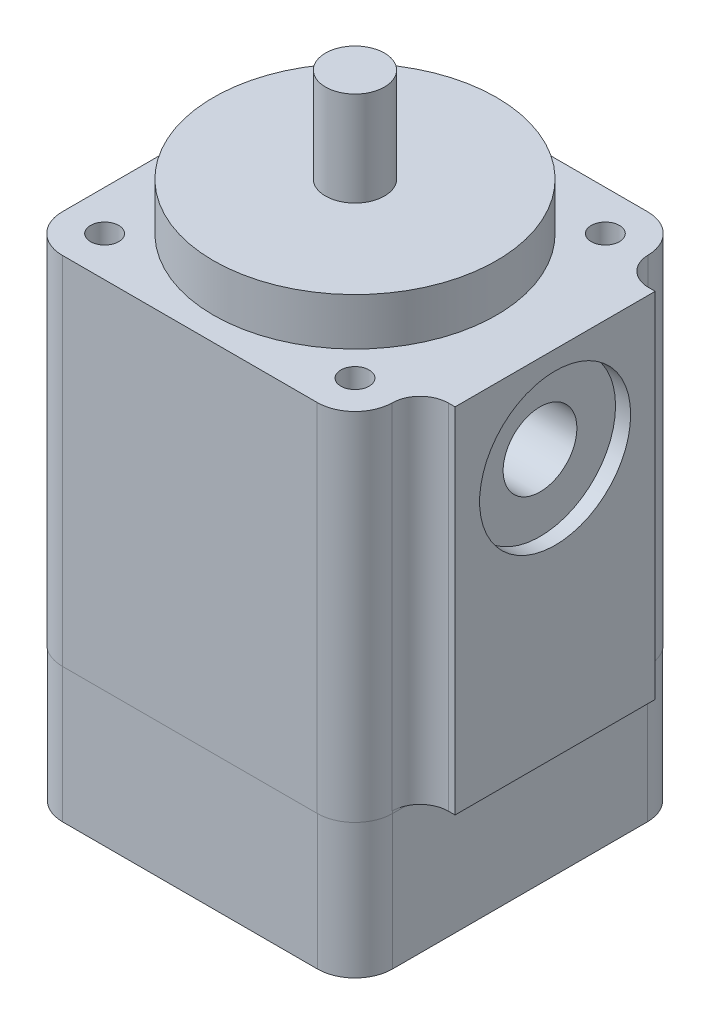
ISO-10303-21;
HEADER;
FILE_DESCRIPTION(('STEP AP214'),'2;1');
FILE_NAME('part.step','',(''),(''),'','','');
FILE_SCHEMA(('AUTOMOTIVE_DESIGN { 1 0 10303 214 1 1 1 1 }'));
ENDSEC;
DATA;
#1=APPLICATION_CONTEXT('core data for automotive mechanical design processes');
#2=APPLICATION_PROTOCOL_DEFINITION('international standard','automotive_design',2000,#1);
#3=PRODUCT_CONTEXT('',#1,'mechanical');
#4=PRODUCT('Part','Part','',(#3));
#5=PRODUCT_RELATED_PRODUCT_CATEGORY('part','',(#4));
#6=PRODUCT_DEFINITION_FORMATION('','',#4);
#7=PRODUCT_DEFINITION_CONTEXT('part definition',#1,'design');
#8=PRODUCT_DEFINITION('design','',#6,#7);
#9=PRODUCT_DEFINITION_SHAPE('','',#8);
#10=(LENGTH_UNIT() NAMED_UNIT(*) SI_UNIT(.MILLI.,.METRE.));
#11=(NAMED_UNIT(*) PLANE_ANGLE_UNIT() SI_UNIT($,.RADIAN.));
#12=(NAMED_UNIT(*) SI_UNIT($,.STERADIAN.) SOLID_ANGLE_UNIT());
#13=UNCERTAINTY_MEASURE_WITH_UNIT(LENGTH_MEASURE(1.E-05),#10,'distance_accuracy_value','');
#14=(GEOMETRIC_REPRESENTATION_CONTEXT(3) GLOBAL_UNCERTAINTY_ASSIGNED_CONTEXT((#13)) GLOBAL_UNIT_ASSIGNED_CONTEXT((#10,
#11,#12)) REPRESENTATION_CONTEXT('',''));
#15=CARTESIAN_POINT('',(0.,0.,0.));
#16=DIRECTION('',(0.,0.,1.));
#17=DIRECTION('',(1.,0.,0.));
#18=AXIS2_PLACEMENT_3D('',#15,#16,#17);
#19=CARTESIAN_POINT('',(0.,85.09,0.));
#20=DIRECTION('',(0.,-1.,0.));
#21=DIRECTION('',(0.,0.,-1.));
#22=AXIS2_PLACEMENT_3D('',#19,#20,#21);
#23=PLANE('',#22);
#24=CARTESIAN_POINT('',(0.,85.09,0.));
#25=DIRECTION('',(0.,-1.,0.));
#26=DIRECTION('',(0.,0.,-1.));
#27=AXIS2_PLACEMENT_3D('',#24,#25,#26);
#28=CIRCLE('',#27,3.9624);
#29=CARTESIAN_POINT('',(0.,85.09,-3.9624));
#30=VERTEX_POINT('',#29);
#31=EDGE_CURVE('E11',#30,#30,#28,.T.);
#32=ORIENTED_EDGE('',*,*,#31,.F.);
#33=EDGE_LOOP('',(#32));
#34=FACE_BOUND('',#33,.T.);
#35=ADVANCED_FACE('F46',(#34),#23,.F.);
#36=CARTESIAN_POINT('',(0.,0.,0.));
#37=DIRECTION('',(0.,-1.,0.));
#38=DIRECTION('',(0.,0.,-1.));
#39=AXIS2_PLACEMENT_3D('',#36,#37,#38);
#40=CYLINDRICAL_SURFACE('',#39,3.9624);
#41=CARTESIAN_POINT('',(0.,46.99,0.));
#42=DIRECTION('',(0.,-1.,0.));
#43=DIRECTION('',(0.,0.,-1.));
#44=AXIS2_PLACEMENT_3D('',#41,#42,#43);
#45=CIRCLE('',#44,3.9624);
#46=CARTESIAN_POINT('',(0.,46.99,-3.9624));
#47=VERTEX_POINT('',#46);
#48=EDGE_CURVE('E52',#47,#47,#45,.T.);
#49=ORIENTED_EDGE('',*,*,#48,.F.);
#50=EDGE_LOOP('',(#49));
#51=FACE_BOUND('',#50,.T.);
#52=ORIENTED_EDGE('',*,*,#31,.T.);
#53=EDGE_LOOP('',(#52));
#54=FACE_BOUND('',#53,.T.);
#55=ADVANCED_FACE('F60',(#51,#54),#40,.T.);
#56=CARTESIAN_POINT('',(0.,46.99,0.));
#57=DIRECTION('',(0.,1.,0.));
#58=DIRECTION('',(0.,0.,1.));
#59=AXIS2_PLACEMENT_3D('',#56,#57,#58);
#60=PLANE('',#59);
#61=ORIENTED_EDGE('',*,*,#48,.T.);
#62=EDGE_LOOP('',(#61));
#63=FACE_BOUND('',#62,.T.);
#64=ADVANCED_FACE('F58',(#63),#60,.F.);
#65=CLOSED_SHELL('',(#35,#55,#64));
#66=MANIFOLD_SOLID_BREP('B2',#65);
#67=CARTESIAN_POINT('',(26.924,53.34,0.));
#68=DIRECTION('',(1.,0.,0.));
#69=DIRECTION('',(0.,0.,-1.));
#70=AXIS2_PLACEMENT_3D('',#67,#68,#69);
#71=CYLINDRICAL_SURFACE('',#70,4.96061999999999);
#72=CARTESIAN_POINT('',(0.761999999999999,53.34,0.));
#73=DIRECTION('',(1.,0.,0.));
#74=DIRECTION('',(0.,0.,-1.));
#75=AXIS2_PLACEMENT_3D('',#72,#73,#74);
#76=CIRCLE('',#75,4.96061999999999);
#77=CARTESIAN_POINT('',(0.761999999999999,50.2679618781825,-3.89491111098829));
#78=VERTEX_POINT('',#77);
#79=CARTESIAN_POINT('',(0.761999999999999,56.4120381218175,-3.89491111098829));
#80=VERTEX_POINT('',#79);
#81=EDGE_CURVE('E441',#78,#80,#76,.T.);
#82=ORIENTED_EDGE('',*,*,#81,.F.);
#83=CARTESIAN_POINT('',(0.761999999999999,50.2679618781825,3.89491111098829));
#84=CARTESIAN_POINT('',(0.872602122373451,50.2405079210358,3.87326278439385));
#85=CARTESIAN_POINT('',(0.98086788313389,50.2080619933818,3.84720182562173));
#86=CARTESIAN_POINT('',(1.19218803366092,50.1355929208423,3.78704563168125));
#87=CARTESIAN_POINT('',(1.29525636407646,50.0955915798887,3.75297344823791));
#88=CARTESIAN_POINT('',(1.49566621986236,50.0104944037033,3.67768316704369));
#89=CARTESIAN_POINT('',(1.5930386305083,49.9654308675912,3.63650956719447));
#90=CARTESIAN_POINT('',(1.78287873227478,49.871768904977,3.54729779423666));
#91=CARTESIAN_POINT('',(1.87534246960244,49.8231677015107,3.49925419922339));
#92=CARTESIAN_POINT('',(2.14346593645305,49.6754411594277,3.34643132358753));
#93=CARTESIAN_POINT('',(2.31214160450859,49.5733482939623,3.2320830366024));
#94=CARTESIAN_POINT('',(2.63072429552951,49.3697905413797,2.97855163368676));
#95=CARTESIAN_POINT('',(2.78058879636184,49.2683275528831,2.83931391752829));
#96=CARTESIAN_POINT('',(3.06070716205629,49.0721379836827,2.53499263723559));
#97=CARTESIAN_POINT('',(3.19076478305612,48.9774831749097,2.36967981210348));
#98=CARTESIAN_POINT('',(3.4256245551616,48.8028705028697,2.01521458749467));
#99=CARTESIAN_POINT('',(3.53047206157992,48.7228863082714,1.82610594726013));
#100=CARTESIAN_POINT('',(3.69375347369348,48.5967494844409,1.46266618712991));
#101=CARTESIAN_POINT('',(3.75714272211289,48.5470998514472,1.2917896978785));
#102=CARTESIAN_POINT('',(3.86044559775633,48.4657005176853,0.938962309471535));
#103=CARTESIAN_POINT('',(3.90037223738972,48.4339408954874,0.757017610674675));
#104=CARTESIAN_POINT('',(3.95439235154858,48.3908866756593,0.386039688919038));
#105=CARTESIAN_POINT('',(3.96836910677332,48.3796845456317,0.196978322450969));
#106=CARTESIAN_POINT('',(3.96911526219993,48.3790879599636,-0.181225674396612));
#107=CARTESIAN_POINT('',(3.95588783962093,48.3896909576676,-0.370368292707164));
#108=CARTESIAN_POINT('',(3.9051423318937,48.4301422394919,-0.728854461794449));
#109=CARTESIAN_POINT('',(3.86946961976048,48.4585277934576,-0.898634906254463));
#110=CARTESIAN_POINT('',(3.7775713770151,48.5310474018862,-1.22896239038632));
#111=CARTESIAN_POINT('',(3.72134037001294,48.5751856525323,-1.38950695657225));
#112=CARTESIAN_POINT('',(3.5858484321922,48.680266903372,-1.71034193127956));
#113=CARTESIAN_POINT('',(3.50516429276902,48.7422305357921,-1.86968958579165));
#114=CARTESIAN_POINT('',(3.32589301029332,48.877391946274,-2.17265656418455));
#115=CARTESIAN_POINT('',(3.22730049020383,48.9505930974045,-2.31627114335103));
#116=CARTESIAN_POINT('',(2.99373860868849,49.1196332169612,-2.61361058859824));
#117=CARTESIAN_POINT('',(2.85542809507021,49.2170940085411,-2.76377649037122));
#118=CARTESIAN_POINT('',(2.5590236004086,49.4165786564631,-3.04032718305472));
#119=CARTESIAN_POINT('',(2.4008891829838,49.5186115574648,-3.16666200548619));
#120=CARTESIAN_POINT('',(2.15139891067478,49.6683476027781,-3.33651112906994));
#121=CARTESIAN_POINT('',(2.0670390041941,49.7172610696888,-3.38944204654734));
#122=CARTESIAN_POINT('',(1.89374016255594,49.8132726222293,-3.48923040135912));
#123=CARTESIAN_POINT('',(1.80480006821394,49.8603702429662,-3.53608629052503));
#124=CARTESIAN_POINT('',(1.62270487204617,49.9512320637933,-3.62325141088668));
#125=CARTESIAN_POINT('',(1.52957009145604,49.995010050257,-3.66358860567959));
#126=CARTESIAN_POINT('',(1.33867874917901,50.0778764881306,-3.73756365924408));
#127=CARTESIAN_POINT('',(1.2409247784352,50.116967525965,-3.77120521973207));
#128=CARTESIAN_POINT('',(1.07945788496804,50.1747643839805,-3.81966782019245));
#129=CARTESIAN_POINT('',(1.01715104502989,50.1955189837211,-3.83674440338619));
#130=CARTESIAN_POINT('',(0.890820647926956,50.2340848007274,-3.86803010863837));
#131=CARTESIAN_POINT('',(0.826794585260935,50.251891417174,-3.88223475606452));
#132=CARTESIAN_POINT('',(0.761999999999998,50.2679618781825,-3.89491111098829));
#133=B_SPLINE_CURVE_WITH_KNOTS('',3,(#83,#84,#85,#86,#87,#88,#89,#90,#91,#92,#93,#94,#95,#96,
#97,#98,#99,#100,#101,#102,#103,#104,#105,#106,#107,#108,#109,#110,#111,#112,#113,#114,#115,
#116,#117,#118,#119,#120,#121,#122,#123,#124,#125,#126,#127,#128,#129,#130,#131,#132),
.UNSPECIFIED.,.F.,.F.,(4,2,2,2,2,2,2,2,2,2,2,2,2,2,2,2,2,2,2,2,2,2,2,2,4),(0.,0.347455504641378,
0.693923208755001,1.03829395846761,1.38293800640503,2.06432483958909,2.7472252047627,
3.43650407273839,4.12453342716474,4.68887944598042,5.25291218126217,5.819475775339,
6.38597320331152,6.91108033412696,7.43632744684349,8.00141087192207,8.56666424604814,
9.24299422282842,9.92072692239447,10.2533741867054,10.5861060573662,10.9173703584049,
11.2484510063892,11.451886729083,11.6556370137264),.UNSPECIFIED.);
#134=CARTESIAN_POINT('',(0.761999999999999,50.2679618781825,3.89491111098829));
#135=VERTEX_POINT('',#134);
#136=EDGE_CURVE('E543',#135,#78,#133,.T.);
#137=ORIENTED_EDGE('',*,*,#136,.F.);
#138=CARTESIAN_POINT('',(0.761999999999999,56.4120381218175,3.89491111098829));
#139=VERTEX_POINT('',#138);
#140=EDGE_CURVE('E444',#139,#135,#76,.T.);
#141=ORIENTED_EDGE('',*,*,#140,.F.);
#142=CARTESIAN_POINT('',(0.761999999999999,56.4120381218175,-3.89491111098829));
#143=CARTESIAN_POINT('',(0.872602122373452,56.4394920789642,-3.87326278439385));
#144=CARTESIAN_POINT('',(0.980867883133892,56.4719380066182,-3.84720182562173));
#145=CARTESIAN_POINT('',(1.19218803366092,56.5444070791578,-3.78704563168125));
#146=CARTESIAN_POINT('',(1.29525636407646,56.5844084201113,-3.75297344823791));
#147=CARTESIAN_POINT('',(1.49566621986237,56.6695055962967,-3.67768316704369));
#148=CARTESIAN_POINT('',(1.5930386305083,56.7145691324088,-3.63650956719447));
#149=CARTESIAN_POINT('',(1.78287873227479,56.808231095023,-3.54729779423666));
#150=CARTESIAN_POINT('',(1.87534246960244,56.8568322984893,-3.49925419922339));
#151=CARTESIAN_POINT('',(2.14346593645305,57.0045588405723,-3.34643132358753));
#152=CARTESIAN_POINT('',(2.31214160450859,57.1066517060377,-3.2320830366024));
#153=CARTESIAN_POINT('',(2.63072429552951,57.3102094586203,-2.97855163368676));
#154=CARTESIAN_POINT('',(2.78058879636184,57.4116724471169,-2.83931391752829));
#155=CARTESIAN_POINT('',(3.06070716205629,57.6078620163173,-2.53499263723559));
#156=CARTESIAN_POINT('',(3.19076478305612,57.7025168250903,-2.36967981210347));
#157=CARTESIAN_POINT('',(3.4256245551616,57.8771294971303,-2.01521458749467));
#158=CARTESIAN_POINT('',(3.53047206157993,57.9571136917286,-1.82610594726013));
#159=CARTESIAN_POINT('',(3.69375347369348,58.0832505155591,-1.4626661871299));
#160=CARTESIAN_POINT('',(3.75714272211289,58.1329001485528,-1.2917896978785));
#161=CARTESIAN_POINT('',(3.86044559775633,58.2142994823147,-0.938962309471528));
#162=CARTESIAN_POINT('',(3.90037223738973,58.2460591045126,-0.757017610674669));
#163=CARTESIAN_POINT('',(3.95439235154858,58.2891133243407,-0.386039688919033));
#164=CARTESIAN_POINT('',(3.96836910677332,58.3003154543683,-0.196978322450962));
#165=CARTESIAN_POINT('',(3.96911526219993,58.3009120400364,0.181225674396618));
#166=CARTESIAN_POINT('',(3.95588783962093,58.2903090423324,0.37036829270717));
#167=CARTESIAN_POINT('',(3.9051423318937,58.2498577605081,0.728854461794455));
#168=CARTESIAN_POINT('',(3.86946961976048,58.2214722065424,0.89863490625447));
#169=CARTESIAN_POINT('',(3.7775713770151,58.1489525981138,1.22896239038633));
#170=CARTESIAN_POINT('',(3.72134037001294,58.1048143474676,1.38950695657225));
#171=CARTESIAN_POINT('',(3.5858484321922,57.999733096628,1.71034193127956));
#172=CARTESIAN_POINT('',(3.50516429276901,57.9377694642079,1.86968958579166));
#173=CARTESIAN_POINT('',(3.32589301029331,57.802608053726,2.17265656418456));
#174=CARTESIAN_POINT('',(3.22730049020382,57.7294069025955,2.31627114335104));
#175=CARTESIAN_POINT('',(2.99373860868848,57.5603667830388,2.61361058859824));
#176=CARTESIAN_POINT('',(2.8554280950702,57.4629059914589,2.76377649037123));
#177=CARTESIAN_POINT('',(2.5590236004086,57.2634213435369,3.04032718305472));
#178=CARTESIAN_POINT('',(2.40088918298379,57.1613884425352,3.16666200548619));
#179=CARTESIAN_POINT('',(2.15139891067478,57.0116523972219,3.33651112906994));
#180=CARTESIAN_POINT('',(2.0670390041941,56.9627389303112,3.38944204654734));
#181=CARTESIAN_POINT('',(1.89374016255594,56.8667273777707,3.48923040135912));
#182=CARTESIAN_POINT('',(1.80480006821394,56.8196297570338,3.53608629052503));
#183=CARTESIAN_POINT('',(1.62270487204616,56.7287679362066,3.62325141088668));
#184=CARTESIAN_POINT('',(1.52957009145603,56.684989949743,3.66358860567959));
#185=CARTESIAN_POINT('',(1.33867874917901,56.6021235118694,3.73756365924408));
#186=CARTESIAN_POINT('',(1.24092477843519,56.563032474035,3.77120521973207));
#187=CARTESIAN_POINT('',(1.07945788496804,56.5052356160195,3.81966782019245));
#188=CARTESIAN_POINT('',(1.01715104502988,56.4844810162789,3.8367444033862));
#189=CARTESIAN_POINT('',(0.890820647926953,56.4459151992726,3.86803010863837));
#190=CARTESIAN_POINT('',(0.826794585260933,56.428108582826,3.88223475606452));
#191=CARTESIAN_POINT('',(0.761999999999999,56.4120381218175,3.89491111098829));
#192=B_SPLINE_CURVE_WITH_KNOTS('',3,(#142,#143,#144,#145,#146,#147,#148,#149,#150,#151,#152,
#153,#154,#155,#156,#157,#158,#159,#160,#161,#162,#163,#164,#165,#166,#167,#168,#169,#170,#171,
#172,#173,#174,#175,#176,#177,#178,#179,#180,#181,#182,#183,#184,#185,#186,#187,#188,#189,#190,
#191),.UNSPECIFIED.,.F.,.F.,(4,2,2,2,2,2,2,2,2,2,2,2,2,2,2,2,2,2,2,2,2,2,2,2,4),(0.,
0.34745550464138,0.693923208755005,1.03829395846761,1.38293800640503,2.06432483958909,
2.7472252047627,3.4365040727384,4.12453342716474,4.68887944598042,5.25291218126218,
5.819475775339,6.38597320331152,6.91108033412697,7.43632744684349,8.00141087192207,
8.56666424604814,9.24299422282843,9.92072692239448,10.2533741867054,10.5861060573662,
10.9173703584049,11.2484510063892,11.451886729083,11.6556370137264),.UNSPECIFIED.);
#193=EDGE_CURVE('E97',#80,#139,#192,.T.);
#194=ORIENTED_EDGE('',*,*,#193,.F.);
#195=EDGE_LOOP('',(#82,#137,#141,#194));
#196=FACE_BOUND('',#195,.T.);
#197=CARTESIAN_POINT('',(24.892,53.34,0.));
#198=DIRECTION('',(1.,0.,0.));
#199=DIRECTION('',(0.,0.,-1.));
#200=AXIS2_PLACEMENT_3D('',#197,#198,#199);
#201=CIRCLE('',#200,4.96061999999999);
#202=CARTESIAN_POINT('',(24.892,53.34,-4.96061999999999));
#203=VERTEX_POINT('',#202);
#204=EDGE_CURVE('E92',#203,#203,#201,.F.);
#205=ORIENTED_EDGE('',*,*,#204,.F.);
#206=EDGE_LOOP('',(#205));
#207=FACE_BOUND('',#206,.T.);
#208=ADVANCED_FACE('F88',(#196,#207),#71,.F.);
#209=CARTESIAN_POINT('',(22.225,0.,-22.225));
#210=DIRECTION('',(0.,-1.,0.));
#211=DIRECTION('',(0.,0.,-1.));
#212=AXIS2_PLACEMENT_3D('',#209,#210,#211);
#213=PLANE('',#212);
#214=CARTESIAN_POINT('',(16.8402,0.,16.8402));
#215=DIRECTION('',(0.,1.,0.));
#216=DIRECTION('',(0.,0.,1.));
#217=AXIS2_PLACEMENT_3D('',#214,#215,#216);
#218=CIRCLE('',#217,1.89864999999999);
#219=CARTESIAN_POINT('',(16.8402,0.,18.73885));
#220=VERTEX_POINT('',#219);
#221=EDGE_CURVE('E438',#220,#220,#218,.T.);
#222=ORIENTED_EDGE('',*,*,#221,.T.);
#223=EDGE_LOOP('',(#222));
#224=FACE_BOUND('',#223,.T.);
#225=CARTESIAN_POINT('',(-16.8402,0.,-16.8402));
#226=DIRECTION('',(0.,1.,0.));
#227=DIRECTION('',(0.,0.,1.));
#228=AXIS2_PLACEMENT_3D('',#225,#226,#227);
#229=CIRCLE('',#228,1.89864999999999);
#230=CARTESIAN_POINT('',(-16.8402,0.,-14.94155));
#231=VERTEX_POINT('',#230);
#232=EDGE_CURVE('E432',#231,#231,#229,.T.);
#233=ORIENTED_EDGE('',*,*,#232,.T.);
#234=EDGE_LOOP('',(#233));
#235=FACE_BOUND('',#234,.T.);
#236=CARTESIAN_POINT('',(-16.8402,0.,16.8402));
#237=DIRECTION('',(0.,1.,0.));
#238=DIRECTION('',(0.,0.,1.));
#239=AXIS2_PLACEMENT_3D('',#236,#237,#238);
#240=CIRCLE('',#239,1.89864999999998);
#241=CARTESIAN_POINT('',(-16.8402,0.,18.73885));
#242=VERTEX_POINT('',#241);
#243=EDGE_CURVE('E426',#242,#242,#240,.T.);
#244=ORIENTED_EDGE('',*,*,#243,.T.);
#245=EDGE_LOOP('',(#244));
#246=FACE_BOUND('',#245,.T.);
#247=CARTESIAN_POINT('',(16.8402,0.,-16.8402));
#248=DIRECTION('',(0.,1.,0.));
#249=DIRECTION('',(0.,0.,1.));
#250=AXIS2_PLACEMENT_3D('',#247,#248,#249);
#251=CIRCLE('',#250,1.89864999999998);
#252=CARTESIAN_POINT('',(16.8402,0.,-14.94155));
#253=VERTEX_POINT('',#252);
#254=EDGE_CURVE('E420',#253,#253,#251,.T.);
#255=ORIENTED_EDGE('',*,*,#254,.T.);
#256=EDGE_LOOP('',(#255));
#257=FACE_BOUND('',#256,.T.);
#258=CARTESIAN_POINT('',(0.,0.,-9.525));
#259=DIRECTION('',(0.,-1.,0.));
#260=DIRECTION('',(0.,0.,-1.));
#261=AXIS2_PLACEMENT_3D('',#258,#259,#260);
#262=CIRCLE('',#261,10.5);
#263=CARTESIAN_POINT('',(-4.41863949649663,0.,0.));
#264=VERTEX_POINT('',#263);
#265=CARTESIAN_POINT('',(4.41863949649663,0.,0.));
#266=VERTEX_POINT('',#265);
#267=EDGE_CURVE('E382',#264,#266,#262,.T.);
#268=ORIENTED_EDGE('',*,*,#267,.F.);
#269=CARTESIAN_POINT('',(0.,0.,9.525));
#270=DIRECTION('',(0.,-1.,0.));
#271=DIRECTION('',(0.,0.,-1.));
#272=AXIS2_PLACEMENT_3D('',#269,#270,#271);
#273=CIRCLE('',#272,10.5);
#274=EDGE_CURVE('E414',#266,#264,#273,.T.);
#275=ORIENTED_EDGE('',*,*,#274,.F.);
#276=EDGE_LOOP('',(#268,#275));
#277=FACE_BOUND('',#276,.T.);
#278=DIRECTION('',(0.,0.,-1.));
#279=VECTOR('',#278,1.);
#280=CARTESIAN_POINT('',(-22.1742,0.,17.145));
#281=LINE('',#280,#279);
#282=CARTESIAN_POINT('',(-22.1742,0.,17.145));
#283=VERTEX_POINT('',#282);
#284=CARTESIAN_POINT('',(-22.1742,0.,-17.145));
#285=VERTEX_POINT('',#284);
#286=EDGE_CURVE('E293',#283,#285,#281,.T.);
#287=ORIENTED_EDGE('',*,*,#286,.T.);
#288=CARTESIAN_POINT('',(-17.145,0.,-17.145));
#289=DIRECTION('',(0.,-1.,0.));
#290=DIRECTION('',(0.,0.,-1.));
#291=AXIS2_PLACEMENT_3D('',#288,#289,#290);
#292=CIRCLE('',#291,5.0292);
#293=CARTESIAN_POINT('',(-17.145,0.,-22.1742));
#294=VERTEX_POINT('',#293);
#295=EDGE_CURVE('E316',#285,#294,#292,.T.);
#296=ORIENTED_EDGE('',*,*,#295,.T.);
#297=DIRECTION('',(1.,0.,0.));
#298=VECTOR('',#297,1.);
#299=CARTESIAN_POINT('',(-17.145,0.,-22.1742));
#300=LINE('',#299,#298);
#301=CARTESIAN_POINT('',(17.145,0.,-22.1742));
#302=VERTEX_POINT('',#301);
#303=EDGE_CURVE('E273',#294,#302,#300,.T.);
#304=ORIENTED_EDGE('',*,*,#303,.T.);
#305=CARTESIAN_POINT('',(17.145,0.,-17.145));
#306=DIRECTION('',(0.,-1.,0.));
#307=DIRECTION('',(0.,0.,-1.));
#308=AXIS2_PLACEMENT_3D('',#305,#306,#307);
#309=CIRCLE('',#308,5.0292);
#310=CARTESIAN_POINT('',(22.1742,0.,-17.145));
#311=VERTEX_POINT('',#310);
#312=EDGE_CURVE('E104',#302,#311,#309,.T.);
#313=ORIENTED_EDGE('',*,*,#312,.T.);
#314=DIRECTION('',(0.,0.,1.));
#315=VECTOR('',#314,1.);
#316=CARTESIAN_POINT('',(22.1742,0.,-17.145));
#317=LINE('',#316,#315);
#318=CARTESIAN_POINT('',(22.1742,0.,17.145));
#319=VERTEX_POINT('',#318);
#320=EDGE_CURVE('E320',#311,#319,#317,.T.);
#321=ORIENTED_EDGE('',*,*,#320,.T.);
#322=CARTESIAN_POINT('',(17.145,0.,17.145));
#323=DIRECTION('',(0.,-1.,0.));
#324=DIRECTION('',(0.,0.,-1.));
#325=AXIS2_PLACEMENT_3D('',#322,#323,#324);
#326=CIRCLE('',#325,5.0292);
#327=CARTESIAN_POINT('',(17.145,0.,22.1742));
#328=VERTEX_POINT('',#327);
#329=EDGE_CURVE('E323',#319,#328,#326,.T.);
#330=ORIENTED_EDGE('',*,*,#329,.T.);
#331=DIRECTION('',(-1.,0.,0.));
#332=VECTOR('',#331,1.);
#333=CARTESIAN_POINT('',(17.145,0.,22.1742));
#334=LINE('',#333,#332);
#335=CARTESIAN_POINT('',(-17.145,0.,22.1742));
#336=VERTEX_POINT('',#335);
#337=EDGE_CURVE('E326',#328,#336,#334,.T.);
#338=ORIENTED_EDGE('',*,*,#337,.T.);
#339=CARTESIAN_POINT('',(-17.145,0.,17.145));
#340=DIRECTION('',(0.,-1.,0.));
#341=DIRECTION('',(0.,0.,-1.));
#342=AXIS2_PLACEMENT_3D('',#339,#340,#341);
#343=CIRCLE('',#342,5.0292);
#344=EDGE_CURVE('E296',#336,#283,#343,.T.);
#345=ORIENTED_EDGE('',*,*,#344,.T.);
#346=EDGE_LOOP('',(#287,#296,#304,#313,#321,#330,#338,#345));
#347=FACE_BOUND('',#346,.T.);
#348=ADVANCED_FACE('F561',(#224,#235,#246,#257,#277,#347),#213,.T.);
#349=CARTESIAN_POINT('',(22.225,66.04,-22.225));
#350=DIRECTION('',(0.,-1.,0.));
#351=DIRECTION('',(0.,0.,-1.));
#352=AXIS2_PLACEMENT_3D('',#349,#350,#351);
#353=PLANE('',#352);
#354=CARTESIAN_POINT('',(16.8402,66.04,-16.8402));
#355=DIRECTION('',(0.,1.,0.));
#356=DIRECTION('',(0.,0.,1.));
#357=AXIS2_PLACEMENT_3D('',#354,#355,#356);
#358=CIRCLE('',#357,1.89864999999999);
#359=CARTESIAN_POINT('',(16.8402,66.04,-14.94155));
#360=VERTEX_POINT('',#359);
#361=EDGE_CURVE('E417',#360,#360,#358,.T.);
#362=ORIENTED_EDGE('',*,*,#361,.F.);
#363=EDGE_LOOP('',(#362));
#364=FACE_BOUND('',#363,.T.);
#365=CARTESIAN_POINT('',(-16.8402,66.04,-16.8402));
#366=DIRECTION('',(0.,1.,0.));
#367=DIRECTION('',(0.,0.,1.));
#368=AXIS2_PLACEMENT_3D('',#365,#366,#367);
#369=CIRCLE('',#368,1.89864999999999);
#370=CARTESIAN_POINT('',(-16.8402,66.04,-14.94155));
#371=VERTEX_POINT('',#370);
#372=EDGE_CURVE('E429',#371,#371,#369,.T.);
#373=ORIENTED_EDGE('',*,*,#372,.F.);
#374=EDGE_LOOP('',(#373));
#375=FACE_BOUND('',#374,.T.);
#376=DIRECTION('',(-1.,0.,0.));
#377=VECTOR('',#376,1.);
#378=CARTESIAN_POINT('',(-22.225,66.04,-22.225));
#379=LINE('',#378,#377);
#380=CARTESIAN_POINT('',(17.145,66.04,-22.225));
#381=VERTEX_POINT('',#380);
#382=CARTESIAN_POINT('',(-17.145,66.04,-22.225));
#383=VERTEX_POINT('',#382);
#384=EDGE_CURVE('E477',#381,#383,#379,.T.);
#385=ORIENTED_EDGE('',*,*,#384,.T.);
#386=CARTESIAN_POINT('',(-17.145,66.04,-17.145));
#387=DIRECTION('',(0.,-1.,0.));
#388=DIRECTION('',(0.,0.,-1.));
#389=AXIS2_PLACEMENT_3D('',#386,#387,#388);
#390=CIRCLE('',#389,5.08);
#391=CARTESIAN_POINT('',(-22.225,66.04,-17.145));
#392=VERTEX_POINT('',#391);
#393=EDGE_CURVE('E506',#383,#392,#390,.F.);
#394=ORIENTED_EDGE('',*,*,#393,.T.);
#395=DIRECTION('',(0.,0.,1.));
#396=VECTOR('',#395,1.);
#397=CARTESIAN_POINT('',(-22.225,66.04,22.225));
#398=LINE('',#397,#396);
#399=CARTESIAN_POINT('',(-22.225,66.04,17.145));
#400=VERTEX_POINT('',#399);
#401=EDGE_CURVE('E480',#392,#400,#398,.T.);
#402=ORIENTED_EDGE('',*,*,#401,.T.);
#403=CARTESIAN_POINT('',(-17.145,66.04,17.145));
#404=DIRECTION('',(0.,-1.,0.));
#405=DIRECTION('',(0.,0.,-1.));
#406=AXIS2_PLACEMENT_3D('',#403,#404,#405);
#407=CIRCLE('',#406,5.08);
#408=CARTESIAN_POINT('',(-17.145,66.04,22.225));
#409=VERTEX_POINT('',#408);
#410=EDGE_CURVE('E504',#400,#409,#407,.F.);
#411=ORIENTED_EDGE('',*,*,#410,.T.);
#412=DIRECTION('',(1.,0.,0.));
#413=VECTOR('',#412,1.);
#414=CARTESIAN_POINT('',(-22.225,66.04,22.225));
#415=LINE('',#414,#413);
#416=CARTESIAN_POINT('',(17.145,66.04,22.225));
#417=VERTEX_POINT('',#416);
#418=EDGE_CURVE('E483',#409,#417,#415,.T.);
#419=ORIENTED_EDGE('',*,*,#418,.T.);
#420=CARTESIAN_POINT('',(17.145,66.04,17.145));
#421=DIRECTION('',(0.,-1.,0.));
#422=DIRECTION('',(0.,0.,-1.));
#423=AXIS2_PLACEMENT_3D('',#420,#421,#422);
#424=CIRCLE('',#423,5.08);
#425=CARTESIAN_POINT('',(22.224481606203,66.04,17.2175714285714));
#426=VERTEX_POINT('',#425);
#427=EDGE_CURVE('E499',#417,#426,#424,.F.);
#428=ORIENTED_EDGE('',*,*,#427,.T.);
#429=CARTESIAN_POINT('',(26.0340928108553,66.04,17.272));
#430=DIRECTION('',(0.,-1.,0.));
#431=DIRECTION('',(0.,0.,-1.));
#432=AXIS2_PLACEMENT_3D('',#429,#430,#431);
#433=CIRCLE('',#432,3.81);
#434=CARTESIAN_POINT('',(26.0340928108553,66.04,13.462));
#435=VERTEX_POINT('',#434);
#436=EDGE_CURVE('E535',#426,#435,#433,.T.);
#437=ORIENTED_EDGE('',*,*,#436,.T.);
#438=DIRECTION('',(1.,0.,0.));
#439=VECTOR('',#438,1.);
#440=CARTESIAN_POINT('',(26.924,66.04,13.462));
#441=LINE('',#440,#439);
#442=CARTESIAN_POINT('',(26.924,66.04,13.462));
#443=VERTEX_POINT('',#442);
#444=EDGE_CURVE('E452',#435,#443,#441,.T.);
#445=ORIENTED_EDGE('',*,*,#444,.T.);
#446=DIRECTION('',(0.,0.,-1.));
#447=VECTOR('',#446,1.);
#448=CARTESIAN_POINT('',(26.924,66.04,-13.462));
#449=LINE('',#448,#447);
#450=CARTESIAN_POINT('',(26.924,66.04,-13.462));
#451=VERTEX_POINT('',#450);
#452=EDGE_CURVE('E449',#443,#451,#449,.T.);
#453=ORIENTED_EDGE('',*,*,#452,.T.);
#454=DIRECTION('',(-1.,0.,0.));
#455=VECTOR('',#454,1.);
#456=CARTESIAN_POINT('',(22.225,66.04,-13.462));
#457=LINE('',#456,#455);
#458=CARTESIAN_POINT('',(26.0340928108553,66.04,-13.462));
#459=VERTEX_POINT('',#458);
#460=EDGE_CURVE('E445',#451,#459,#457,.T.);
#461=ORIENTED_EDGE('',*,*,#460,.T.);
#462=CARTESIAN_POINT('',(26.0340928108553,66.04,-17.272));
#463=DIRECTION('',(0.,-1.,0.));
#464=DIRECTION('',(0.,0.,-1.));
#465=AXIS2_PLACEMENT_3D('',#462,#463,#464);
#466=CIRCLE('',#465,3.81);
#467=CARTESIAN_POINT('',(22.224481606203,66.04,-17.2175714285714));
#468=VERTEX_POINT('',#467);
#469=EDGE_CURVE('E539',#459,#468,#466,.T.);
#470=ORIENTED_EDGE('',*,*,#469,.T.);
#471=CARTESIAN_POINT('',(17.145,66.04,-17.145));
#472=DIRECTION('',(0.,-1.,0.));
#473=DIRECTION('',(0.,0.,-1.));
#474=AXIS2_PLACEMENT_3D('',#471,#472,#473);
#475=CIRCLE('',#474,5.08);
#476=EDGE_CURVE('E502',#468,#381,#475,.F.);
#477=ORIENTED_EDGE('',*,*,#476,.T.);
#478=EDGE_LOOP('',(#385,#394,#402,#411,#419,#428,#437,#445,#453,#461,#470,#477));
#479=FACE_BOUND('',#478,.T.);
#480=CARTESIAN_POINT('',(0.,66.04,0.));
#481=DIRECTION('',(0.,-1.,0.));
#482=DIRECTION('',(0.,0.,-1.));
#483=AXIS2_PLACEMENT_3D('',#480,#481,#482);
#484=CIRCLE('',#483,19.0373);
#485=CARTESIAN_POINT('',(0.,66.04,-19.0373));
#486=VERTEX_POINT('',#485);
#487=EDGE_CURVE('E486',#486,#486,#484,.F.);
#488=ORIENTED_EDGE('',*,*,#487,.F.);
#489=EDGE_LOOP('',(#488));
#490=FACE_BOUND('',#489,.T.);
#491=CARTESIAN_POINT('',(16.8402,66.04,16.8402));
#492=DIRECTION('',(0.,1.,0.));
#493=DIRECTION('',(0.,0.,1.));
#494=AXIS2_PLACEMENT_3D('',#491,#492,#493);
#495=CIRCLE('',#494,1.89864999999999);
#496=CARTESIAN_POINT('',(16.8402,66.04,18.73885));
#497=VERTEX_POINT('',#496);
#498=EDGE_CURVE('E435',#497,#497,#495,.T.);
#499=ORIENTED_EDGE('',*,*,#498,.F.);
#500=EDGE_LOOP('',(#499));
#501=FACE_BOUND('',#500,.T.);
#502=CARTESIAN_POINT('',(-16.8402,66.04,16.8402));
#503=DIRECTION('',(0.,1.,0.));
#504=DIRECTION('',(0.,0.,1.));
#505=AXIS2_PLACEMENT_3D('',#502,#503,#504);
#506=CIRCLE('',#505,1.89864999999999);
#507=CARTESIAN_POINT('',(-16.8402,66.04,18.73885));
#508=VERTEX_POINT('',#507);
#509=EDGE_CURVE('E423',#508,#508,#506,.T.);
#510=ORIENTED_EDGE('',*,*,#509,.F.);
#511=EDGE_LOOP('',(#510));
#512=FACE_BOUND('',#511,.T.);
#513=ADVANCED_FACE('F623',(#364,#375,#479,#490,#501,#512),#353,.F.);
#514=CARTESIAN_POINT('',(22.225,66.04,22.225));
#515=DIRECTION('',(-1.,0.,0.));
#516=DIRECTION('',(0.,0.,1.));
#517=AXIS2_PLACEMENT_3D('',#514,#515,#516);
#518=PLANE('',#517);
#519=DIRECTION('',(0.,-1.,0.));
#520=VECTOR('',#519,1.);
#521=CARTESIAN_POINT('',(22.225,66.04,17.145));
#522=LINE('',#521,#520);
#523=CARTESIAN_POINT('',(22.225,18.4912,17.145));
#524=VERTEX_POINT('',#523);
#525=CARTESIAN_POINT('',(22.225,18.161,17.145));
#526=VERTEX_POINT('',#525);
#527=EDGE_CURVE('E513',#524,#526,#522,.T.);
#528=ORIENTED_EDGE('',*,*,#527,.T.);
#529=DIRECTION('',(0.,0.,-1.));
#530=VECTOR('',#529,1.);
#531=CARTESIAN_POINT('',(22.225,18.161,22.225));
#532=LINE('',#531,#530);
#533=CARTESIAN_POINT('',(22.225,18.161,-17.145));
#534=VERTEX_POINT('',#533);
#535=EDGE_CURVE('E111',#526,#534,#532,.T.);
#536=ORIENTED_EDGE('',*,*,#535,.T.);
#537=DIRECTION('',(0.,-1.,0.));
#538=VECTOR('',#537,1.);
#539=CARTESIAN_POINT('',(22.225,66.04,-17.145));
#540=LINE('',#539,#538);
#541=CARTESIAN_POINT('',(22.225,18.4912,-17.145));
#542=VERTEX_POINT('',#541);
#543=EDGE_CURVE('E516',#534,#542,#540,.F.);
#544=ORIENTED_EDGE('',*,*,#543,.T.);
#545=DIRECTION('',(0.,0.,1.));
#546=VECTOR('',#545,1.);
#547=CARTESIAN_POINT('',(22.225,18.4912,-13.462));
#548=LINE('',#547,#546);
#549=EDGE_CURVE('E456',#542,#524,#548,.T.);
#550=ORIENTED_EDGE('',*,*,#549,.T.);
#551=EDGE_LOOP('',(#528,#536,#544,#550));
#552=FACE_BOUND('',#551,.T.);
#553=ADVANCED_FACE('F654',(#552),#518,.F.);
#554=CARTESIAN_POINT('',(-22.225,66.04,-22.225));
#555=DIRECTION('',(0.,0.,1.));
#556=DIRECTION('',(1.,0.,0.));
#557=AXIS2_PLACEMENT_3D('',#554,#555,#556);
#558=PLANE('',#557);
#559=DIRECTION('',(0.,-1.,0.));
#560=VECTOR('',#559,1.);
#561=CARTESIAN_POINT('',(17.145,66.04,-22.225));
#562=LINE('',#561,#560);
#563=CARTESIAN_POINT('',(17.145,18.161,-22.225));
#564=VERTEX_POINT('',#563);
#565=EDGE_CURVE('E494',#381,#564,#562,.T.);
#566=ORIENTED_EDGE('',*,*,#565,.T.);
#567=DIRECTION('',(-1.,0.,0.));
#568=VECTOR('',#567,1.);
#569=CARTESIAN_POINT('',(-22.225,18.161,-22.225));
#570=LINE('',#569,#568);
#571=CARTESIAN_POINT('',(-17.145,18.161,-22.225));
#572=VERTEX_POINT('',#571);
#573=EDGE_CURVE('E354',#564,#572,#570,.T.);
#574=ORIENTED_EDGE('',*,*,#573,.T.);
#575=DIRECTION('',(0.,-1.,0.));
#576=VECTOR('',#575,1.);
#577=CARTESIAN_POINT('',(-17.145,66.04,-22.225));
#578=LINE('',#577,#576);
#579=EDGE_CURVE('E497',#572,#383,#578,.F.);
#580=ORIENTED_EDGE('',*,*,#579,.T.);
#581=ORIENTED_EDGE('',*,*,#384,.F.);
#582=EDGE_LOOP('',(#566,#574,#580,#581));
#583=FACE_BOUND('',#582,.T.);
#584=ADVANCED_FACE('F646',(#583),#558,.F.);
#585=CARTESIAN_POINT('',(-22.225,66.04,22.225));
#586=DIRECTION('',(1.,0.,0.));
#587=DIRECTION('',(0.,0.,-1.));
#588=AXIS2_PLACEMENT_3D('',#585,#586,#587);
#589=PLANE('',#588);
#590=DIRECTION('',(0.,-1.,0.));
#591=VECTOR('',#590,1.);
#592=CARTESIAN_POINT('',(-22.225,66.04,-17.145));
#593=LINE('',#592,#591);
#594=CARTESIAN_POINT('',(-22.225,18.161,-17.145));
#595=VERTEX_POINT('',#594);
#596=EDGE_CURVE('E491',#392,#595,#593,.T.);
#597=ORIENTED_EDGE('',*,*,#596,.T.);
#598=DIRECTION('',(0.,0.,1.));
#599=VECTOR('',#598,1.);
#600=CARTESIAN_POINT('',(-22.225,18.161,22.225));
#601=LINE('',#600,#599);
#602=CARTESIAN_POINT('',(-22.225,18.161,17.145));
#603=VERTEX_POINT('',#602);
#604=EDGE_CURVE('E351',#595,#603,#601,.T.);
#605=ORIENTED_EDGE('',*,*,#604,.T.);
#606=DIRECTION('',(0.,-1.,0.));
#607=VECTOR('',#606,1.);
#608=CARTESIAN_POINT('',(-22.225,66.04,17.145));
#609=LINE('',#608,#607);
#610=EDGE_CURVE('E489',#603,#400,#609,.F.);
#611=ORIENTED_EDGE('',*,*,#610,.T.);
#612=ORIENTED_EDGE('',*,*,#401,.F.);
#613=EDGE_LOOP('',(#597,#605,#611,#612));
#614=FACE_BOUND('',#613,.T.);
#615=ADVANCED_FACE('F637',(#614),#589,.F.);
#616=CARTESIAN_POINT('',(-22.225,66.04,22.225));
#617=DIRECTION('',(0.,0.,-1.));
#618=DIRECTION('',(-1.,0.,0.));
#619=AXIS2_PLACEMENT_3D('',#616,#617,#618);
#620=PLANE('',#619);
#621=DIRECTION('',(0.,-1.,0.));
#622=VECTOR('',#621,1.);
#623=CARTESIAN_POINT('',(-17.145,66.04,22.225));
#624=LINE('',#623,#622);
#625=CARTESIAN_POINT('',(-17.145,18.161,22.225));
#626=VERTEX_POINT('',#625);
#627=EDGE_CURVE('E510',#409,#626,#624,.T.);
#628=ORIENTED_EDGE('',*,*,#627,.T.);
#629=DIRECTION('',(1.,0.,0.));
#630=VECTOR('',#629,1.);
#631=CARTESIAN_POINT('',(-22.225,18.161,22.225));
#632=LINE('',#631,#630);
#633=CARTESIAN_POINT('',(17.145,18.161,22.225));
#634=VERTEX_POINT('',#633);
#635=EDGE_CURVE('E332',#626,#634,#632,.T.);
#636=ORIENTED_EDGE('',*,*,#635,.T.);
#637=DIRECTION('',(0.,-1.,0.));
#638=VECTOR('',#637,1.);
#639=CARTESIAN_POINT('',(17.145,66.04,22.225));
#640=LINE('',#639,#638);
#641=EDGE_CURVE('E508',#634,#417,#640,.F.);
#642=ORIENTED_EDGE('',*,*,#641,.T.);
#643=ORIENTED_EDGE('',*,*,#418,.F.);
#644=EDGE_LOOP('',(#628,#636,#642,#643));
#645=FACE_BOUND('',#644,.T.);
#646=ADVANCED_FACE('F630',(#645),#620,.F.);
#647=CARTESIAN_POINT('',(0.,72.39,0.));
#648=DIRECTION('',(0.,-1.,0.));
#649=DIRECTION('',(0.,0.,-1.));
#650=AXIS2_PLACEMENT_3D('',#647,#648,#649);
#651=CYLINDRICAL_SURFACE('',#650,19.0373);
#652=CARTESIAN_POINT('',(0.,72.39,0.));
#653=DIRECTION('',(0.,1.,0.));
#654=DIRECTION('',(0.,0.,1.));
#655=AXIS2_PLACEMENT_3D('',#652,#653,#654);
#656=CIRCLE('',#655,19.0373);
#657=CARTESIAN_POINT('',(0.,72.39,19.0373));
#658=VERTEX_POINT('',#657);
#659=EDGE_CURVE('E474',#658,#658,#656,.T.);
#660=ORIENTED_EDGE('',*,*,#659,.F.);
#661=EDGE_LOOP('',(#660));
#662=FACE_BOUND('',#661,.T.);
#663=ORIENTED_EDGE('',*,*,#487,.T.);
#664=EDGE_LOOP('',(#663));
#665=FACE_BOUND('',#664,.T.);
#666=ADVANCED_FACE('F992',(#662,#665),#651,.T.);
#667=CARTESIAN_POINT('',(0.,72.39,0.));
#668=DIRECTION('',(0.,1.,0.));
#669=DIRECTION('',(0.,0.,1.));
#670=AXIS2_PLACEMENT_3D('',#667,#668,#669);
#671=PLANE('',#670);
#672=CARTESIAN_POINT('',(0.,72.39,0.));
#673=DIRECTION('',(0.,1.,0.));
#674=DIRECTION('',(0.,0.,1.));
#675=AXIS2_PLACEMENT_3D('',#672,#673,#674);
#676=CIRCLE('',#675,3.96875);
#677=CARTESIAN_POINT('',(0.,72.39,3.96875));
#678=VERTEX_POINT('',#677);
#679=EDGE_CURVE('E458',#678,#678,#676,.T.);
#680=ORIENTED_EDGE('',*,*,#679,.F.);
#681=EDGE_LOOP('',(#680));
#682=FACE_BOUND('',#681,.T.);
#683=ORIENTED_EDGE('',*,*,#659,.T.);
#684=EDGE_LOOP('',(#683));
#685=FACE_BOUND('',#684,.T.);
#686=ADVANCED_FACE('F1154',(#682,#685),#671,.T.);
#687=CARTESIAN_POINT('',(22.225,35.306,-22.225));
#688=DIRECTION('',(0.,-1.,0.));
#689=DIRECTION('',(0.,0.,-1.));
#690=AXIS2_PLACEMENT_3D('',#687,#688,#689);
#691=PLANE('',#690);
#692=CARTESIAN_POINT('',(0.,35.306,0.));
#693=DIRECTION('',(0.,-1.,0.));
#694=DIRECTION('',(0.,0.,-1.));
#695=AXIS2_PLACEMENT_3D('',#692,#693,#694);
#696=CIRCLE('',#695,3.96875);
#697=CARTESIAN_POINT('',(0.,35.306,-3.96875));
#698=VERTEX_POINT('',#697);
#699=EDGE_CURVE('E471',#698,#698,#696,.F.);
#700=ORIENTED_EDGE('',*,*,#699,.T.);
#701=EDGE_LOOP('',(#700));
#702=FACE_BOUND('',#701,.T.);
#703=ADVANCED_FACE('F707',(#702),#691,.F.);
#704=CARTESIAN_POINT('',(0.,-6.65332015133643,0.));
#705=DIRECTION('',(0.,1.,0.));
#706=DIRECTION('',(0.,0.,1.));
#707=AXIS2_PLACEMENT_3D('',#704,#705,#706);
#708=CYLINDRICAL_SURFACE('',#707,3.96875);
#709=DIRECTION('',(0.,1.,0.));
#710=VECTOR('',#709,1.);
#711=CARTESIAN_POINT('',(0.761999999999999,-6.65332015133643,-3.89491111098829));
#712=LINE('',#711,#710);
#713=EDGE_CURVE('E551',#78,#80,#712,.T.);
#714=ORIENTED_EDGE('',*,*,#713,.T.);
#715=ORIENTED_EDGE('',*,*,#193,.T.);
#716=DIRECTION('',(0.,1.,0.));
#717=VECTOR('',#716,1.);
#718=CARTESIAN_POINT('',(0.761999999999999,-6.65332015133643,3.89491111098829));
#719=LINE('',#718,#717);
#720=EDGE_CURVE('E573',#139,#135,#719,.F.);
#721=ORIENTED_EDGE('',*,*,#720,.T.);
#722=ORIENTED_EDGE('',*,*,#136,.T.);
#723=EDGE_LOOP('',(#714,#715,#721,#722));
#724=FACE_BOUND('',#723,.T.);
#725=ORIENTED_EDGE('',*,*,#679,.T.);
#726=EDGE_LOOP('',(#725));
#727=FACE_BOUND('',#726,.T.);
#728=ORIENTED_EDGE('',*,*,#699,.F.);
#729=EDGE_LOOP('',(#728));
#730=FACE_BOUND('',#729,.T.);
#731=ADVANCED_FACE('F553',(#724,#727,#730),#708,.F.);
#732=CARTESIAN_POINT('',(-17.145,66.04,-17.145));
#733=DIRECTION('',(0.,-1.,0.));
#734=DIRECTION('',(0.,0.,-1.));
#735=AXIS2_PLACEMENT_3D('',#732,#733,#734);
#736=CYLINDRICAL_SURFACE('',#735,5.08);
#737=CARTESIAN_POINT('',(-17.145,18.161,-17.145));
#738=DIRECTION('',(0.,1.,0.));
#739=DIRECTION('',(0.,0.,1.));
#740=AXIS2_PLACEMENT_3D('',#737,#738,#739);
#741=CIRCLE('',#740,5.08);
#742=EDGE_CURVE('E357',#595,#572,#741,.F.);
#743=ORIENTED_EDGE('',*,*,#742,.F.);
#744=ORIENTED_EDGE('',*,*,#596,.F.);
#745=ORIENTED_EDGE('',*,*,#393,.F.);
#746=ORIENTED_EDGE('',*,*,#579,.F.);
#747=EDGE_LOOP('',(#743,#744,#745,#746));
#748=FACE_BOUND('',#747,.T.);
#749=ADVANCED_FACE('F642',(#748),#736,.T.);
#750=CARTESIAN_POINT('',(-17.145,66.04,17.145));
#751=DIRECTION('',(0.,-1.,0.));
#752=DIRECTION('',(0.,0.,-1.));
#753=AXIS2_PLACEMENT_3D('',#750,#751,#752);
#754=CYLINDRICAL_SURFACE('',#753,5.08);
#755=CARTESIAN_POINT('',(-17.145,18.161,17.145));
#756=DIRECTION('',(0.,1.,0.));
#757=DIRECTION('',(0.,0.,1.));
#758=AXIS2_PLACEMENT_3D('',#755,#756,#757);
#759=CIRCLE('',#758,5.08);
#760=EDGE_CURVE('E349',#626,#603,#759,.F.);
#761=ORIENTED_EDGE('',*,*,#760,.F.);
#762=ORIENTED_EDGE('',*,*,#627,.F.);
#763=ORIENTED_EDGE('',*,*,#410,.F.);
#764=ORIENTED_EDGE('',*,*,#610,.F.);
#765=EDGE_LOOP('',(#761,#762,#763,#764));
#766=FACE_BOUND('',#765,.T.);
#767=ADVANCED_FACE('F633',(#766),#754,.T.);
#768=CARTESIAN_POINT('',(17.145,66.04,-17.145));
#769=DIRECTION('',(0.,-1.,0.));
#770=DIRECTION('',(0.,0.,-1.));
#771=AXIS2_PLACEMENT_3D('',#768,#769,#770);
#772=CYLINDRICAL_SURFACE('',#771,5.08);
#773=CARTESIAN_POINT('',(17.145,18.161,-17.145));
#774=DIRECTION('',(0.,1.,0.));
#775=DIRECTION('',(0.,0.,1.));
#776=AXIS2_PLACEMENT_3D('',#773,#774,#775);
#777=CIRCLE('',#776,5.08);
#778=EDGE_CURVE('E347',#564,#534,#777,.F.);
#779=ORIENTED_EDGE('',*,*,#778,.F.);
#780=ORIENTED_EDGE('',*,*,#565,.F.);
#781=ORIENTED_EDGE('',*,*,#476,.F.);
#782=DIRECTION('',(0.,-1.,0.));
#783=VECTOR('',#782,1.);
#784=CARTESIAN_POINT('',(22.224481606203,66.04,-17.2175714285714));
#785=LINE('',#784,#783);
#786=CARTESIAN_POINT('',(22.224481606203,18.4912,-17.2175714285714));
#787=VERTEX_POINT('',#786);
#788=EDGE_CURVE('E532',#468,#787,#785,.T.);
#789=ORIENTED_EDGE('',*,*,#788,.T.);
#790=CARTESIAN_POINT('',(17.145,18.4912,-17.145));
#791=DIRECTION('',(0.,-1.,0.));
#792=DIRECTION('',(0.,0.,-1.));
#793=AXIS2_PLACEMENT_3D('',#790,#791,#792);
#794=CIRCLE('',#793,5.08);
#795=EDGE_CURVE('E529',#787,#542,#794,.T.);
#796=ORIENTED_EDGE('',*,*,#795,.T.);
#797=ORIENTED_EDGE('',*,*,#543,.F.);
#798=EDGE_LOOP('',(#779,#780,#781,#789,#796,#797));
#799=FACE_BOUND('',#798,.T.);
#800=ADVANCED_FACE('F651',(#799),#772,.T.);
#801=CARTESIAN_POINT('',(17.145,66.04,17.145));
#802=DIRECTION('',(0.,-1.,0.));
#803=DIRECTION('',(0.,0.,-1.));
#804=AXIS2_PLACEMENT_3D('',#801,#802,#803);
#805=CYLINDRICAL_SURFACE('',#804,5.08);
#806=CARTESIAN_POINT('',(17.145,18.161,17.145));
#807=DIRECTION('',(0.,1.,0.));
#808=DIRECTION('',(0.,0.,1.));
#809=AXIS2_PLACEMENT_3D('',#806,#807,#808);
#810=CIRCLE('',#809,5.08);
#811=EDGE_CURVE('E44',#526,#634,#810,.F.);
#812=ORIENTED_EDGE('',*,*,#811,.F.);
#813=ORIENTED_EDGE('',*,*,#527,.F.);
#814=CARTESIAN_POINT('',(17.145,18.4912,17.145));
#815=DIRECTION('',(0.,-1.,0.));
#816=DIRECTION('',(0.,0.,-1.));
#817=AXIS2_PLACEMENT_3D('',#814,#815,#816);
#818=CIRCLE('',#817,5.08);
#819=CARTESIAN_POINT('',(22.224481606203,18.4912,17.2175714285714));
#820=VERTEX_POINT('',#819);
#821=EDGE_CURVE('E518',#524,#820,#818,.T.);
#822=ORIENTED_EDGE('',*,*,#821,.T.);
#823=DIRECTION('',(0.,-1.,0.));
#824=VECTOR('',#823,1.);
#825=CARTESIAN_POINT('',(22.224481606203,66.04,17.2175714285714));
#826=LINE('',#825,#824);
#827=EDGE_CURVE('E521',#820,#426,#826,.F.);
#828=ORIENTED_EDGE('',*,*,#827,.T.);
#829=ORIENTED_EDGE('',*,*,#427,.F.);
#830=ORIENTED_EDGE('',*,*,#641,.F.);
#831=EDGE_LOOP('',(#812,#813,#822,#828,#829,#830));
#832=FACE_BOUND('',#831,.T.);
#833=ADVANCED_FACE('F619',(#832),#805,.T.);
#834=CARTESIAN_POINT('',(22.225,18.4912,-22.225));
#835=DIRECTION('',(0.,-1.,0.));
#836=DIRECTION('',(0.,0.,-1.));
#837=AXIS2_PLACEMENT_3D('',#834,#835,#836);
#838=PLANE('',#837);
#839=ORIENTED_EDGE('',*,*,#549,.F.);
#840=ORIENTED_EDGE('',*,*,#795,.F.);
#841=CARTESIAN_POINT('',(26.0340928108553,18.4912,-17.272));
#842=DIRECTION('',(0.,-1.,0.));
#843=DIRECTION('',(0.,0.,-1.));
#844=AXIS2_PLACEMENT_3D('',#841,#842,#843);
#845=CIRCLE('',#844,3.81);
#846=CARTESIAN_POINT('',(26.0340928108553,18.4912,-13.462));
#847=VERTEX_POINT('',#846);
#848=EDGE_CURVE('E541',#787,#847,#845,.F.);
#849=ORIENTED_EDGE('',*,*,#848,.T.);
#850=DIRECTION('',(-1.,0.,0.));
#851=VECTOR('',#850,1.);
#852=CARTESIAN_POINT('',(22.225,18.4912,-13.462));
#853=LINE('',#852,#851);
#854=CARTESIAN_POINT('',(26.924,18.4912,-13.462));
#855=VERTEX_POINT('',#854);
#856=EDGE_CURVE('E459',#855,#847,#853,.T.);
#857=ORIENTED_EDGE('',*,*,#856,.F.);
#858=DIRECTION('',(0.,0.,-1.));
#859=VECTOR('',#858,1.);
#860=CARTESIAN_POINT('',(26.924,18.4912,-13.462));
#861=LINE('',#860,#859);
#862=CARTESIAN_POINT('',(26.924,18.4912,13.462));
#863=VERTEX_POINT('',#862);
#864=EDGE_CURVE('E463',#863,#855,#861,.T.);
#865=ORIENTED_EDGE('',*,*,#864,.F.);
#866=DIRECTION('',(1.,0.,0.));
#867=VECTOR('',#866,1.);
#868=CARTESIAN_POINT('',(26.924,18.4912,13.462));
#869=LINE('',#868,#867);
#870=CARTESIAN_POINT('',(26.0340928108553,18.4912,13.462));
#871=VERTEX_POINT('',#870);
#872=EDGE_CURVE('E448',#871,#863,#869,.T.);
#873=ORIENTED_EDGE('',*,*,#872,.F.);
#874=CARTESIAN_POINT('',(26.0340928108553,18.4912,17.272));
#875=DIRECTION('',(0.,-1.,0.));
#876=DIRECTION('',(0.,0.,-1.));
#877=AXIS2_PLACEMENT_3D('',#874,#875,#876);
#878=CIRCLE('',#877,3.81);
#879=EDGE_CURVE('E537',#871,#820,#878,.F.);
#880=ORIENTED_EDGE('',*,*,#879,.T.);
#881=ORIENTED_EDGE('',*,*,#821,.F.);
#882=EDGE_LOOP('',(#839,#840,#849,#857,#865,#873,#880,#881));
#883=FACE_BOUND('',#882,.T.);
#884=ADVANCED_FACE('F602',(#883),#838,.T.);
#885=CARTESIAN_POINT('',(26.924,-27.3309783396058,13.462));
#886=DIRECTION('',(0.,0.,1.));
#887=DIRECTION('',(1.,0.,0.));
#888=AXIS2_PLACEMENT_3D('',#885,#886,#887);
#889=PLANE('',#888);
#890=ORIENTED_EDGE('',*,*,#444,.F.);
#891=DIRECTION('',(0.,1.,0.));
#892=VECTOR('',#891,1.);
#893=CARTESIAN_POINT('',(26.0340928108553,18.4912,13.462));
#894=LINE('',#893,#892);
#895=EDGE_CURVE('E524',#435,#871,#894,.F.);
#896=ORIENTED_EDGE('',*,*,#895,.T.);
#897=ORIENTED_EDGE('',*,*,#872,.T.);
#898=DIRECTION('',(0.,1.,0.));
#899=VECTOR('',#898,1.);
#900=CARTESIAN_POINT('',(26.924,-27.3309783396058,13.462));
#901=LINE('',#900,#899);
#902=EDGE_CURVE('E455',#863,#443,#901,.T.);
#903=ORIENTED_EDGE('',*,*,#902,.T.);
#904=EDGE_LOOP('',(#890,#896,#897,#903));
#905=FACE_BOUND('',#904,.T.);
#906=ADVANCED_FACE('F676',(#905),#889,.T.);
#907=CARTESIAN_POINT('',(26.924,-27.3309783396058,-13.462));
#908=DIRECTION('',(1.,0.,0.));
#909=DIRECTION('',(0.,0.,-1.));
#910=AXIS2_PLACEMENT_3D('',#907,#908,#909);
#911=PLANE('',#910);
#912=CARTESIAN_POINT('',(26.924,53.34,2.35974267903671E-13));
#913=DIRECTION('',(1.,0.,0.));
#914=DIRECTION('',(0.,0.,-1.));
#915=AXIS2_PLACEMENT_3D('',#912,#913,#914);
#916=CIRCLE('',#915,10.16);
#917=CARTESIAN_POINT('',(26.924,53.34,-10.1599999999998));
#918=VERTEX_POINT('',#917);
#919=EDGE_CURVE('E299',#918,#918,#916,.T.);
#920=ORIENTED_EDGE('',*,*,#919,.F.);
#921=EDGE_LOOP('',(#920));
#922=FACE_BOUND('',#921,.T.);
#923=ORIENTED_EDGE('',*,*,#902,.F.);
#924=ORIENTED_EDGE('',*,*,#864,.T.);
#925=DIRECTION('',(0.,1.,0.));
#926=VECTOR('',#925,1.);
#927=CARTESIAN_POINT('',(26.924,-27.3309783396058,-13.462));
#928=LINE('',#927,#926);
#929=EDGE_CURVE('E462',#855,#451,#928,.T.);
#930=ORIENTED_EDGE('',*,*,#929,.T.);
#931=ORIENTED_EDGE('',*,*,#452,.F.);
#932=EDGE_LOOP('',(#923,#924,#930,#931));
#933=FACE_BOUND('',#932,.T.);
#934=ADVANCED_FACE('F610',(#922,#933),#911,.T.);
#935=CARTESIAN_POINT('',(22.225,-27.3309783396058,-13.462));
#936=DIRECTION('',(0.,0.,-1.));
#937=DIRECTION('',(-1.,0.,0.));
#938=AXIS2_PLACEMENT_3D('',#935,#936,#937);
#939=PLANE('',#938);
#940=ORIENTED_EDGE('',*,*,#856,.T.);
#941=DIRECTION('',(0.,1.,0.));
#942=VECTOR('',#941,1.);
#943=CARTESIAN_POINT('',(26.0340928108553,66.04,-13.462));
#944=LINE('',#943,#942);
#945=EDGE_CURVE('E526',#847,#459,#944,.T.);
#946=ORIENTED_EDGE('',*,*,#945,.T.);
#947=ORIENTED_EDGE('',*,*,#460,.F.);
#948=ORIENTED_EDGE('',*,*,#929,.F.);
#949=EDGE_LOOP('',(#940,#946,#947,#948));
#950=FACE_BOUND('',#949,.T.);
#951=ADVANCED_FACE('F595',(#950),#939,.T.);
#952=CARTESIAN_POINT('',(26.0340928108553,66.04,17.272));
#953=DIRECTION('',(0.,-1.,0.));
#954=DIRECTION('',(0.,0.,-1.));
#955=AXIS2_PLACEMENT_3D('',#952,#953,#954);
#956=CYLINDRICAL_SURFACE('',#955,3.81);
#957=ORIENTED_EDGE('',*,*,#879,.F.);
#958=ORIENTED_EDGE('',*,*,#895,.F.);
#959=ORIENTED_EDGE('',*,*,#436,.F.);
#960=ORIENTED_EDGE('',*,*,#827,.F.);
#961=EDGE_LOOP('',(#957,#958,#959,#960));
#962=FACE_BOUND('',#961,.T.);
#963=ADVANCED_FACE('F590',(#962),#956,.F.);
#964=CARTESIAN_POINT('',(26.0340928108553,66.04,-17.272));
#965=DIRECTION('',(0.,-1.,0.));
#966=DIRECTION('',(0.,0.,-1.));
#967=AXIS2_PLACEMENT_3D('',#964,#965,#966);
#968=CYLINDRICAL_SURFACE('',#967,3.81);
#969=ORIENTED_EDGE('',*,*,#848,.F.);
#970=ORIENTED_EDGE('',*,*,#788,.F.);
#971=ORIENTED_EDGE('',*,*,#469,.F.);
#972=ORIENTED_EDGE('',*,*,#945,.F.);
#973=EDGE_LOOP('',(#969,#970,#971,#972));
#974=FACE_BOUND('',#973,.T.);
#975=ADVANCED_FACE('F90',(#974),#968,.F.);
#976=CARTESIAN_POINT('',(0.761999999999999,53.34,0.));
#977=DIRECTION('',(-1.,0.,0.));
#978=DIRECTION('',(0.,0.,1.));
#979=AXIS2_PLACEMENT_3D('',#976,#977,#978);
#980=PLANE('',#979);
#981=ORIENTED_EDGE('',*,*,#140,.T.);
#982=ORIENTED_EDGE('',*,*,#720,.F.);
#983=EDGE_LOOP('',(#981,#982));
#984=FACE_BOUND('',#983,.T.);
#985=ADVANCED_FACE('F565',(#984),#980,.F.);
#986=ORIENTED_EDGE('',*,*,#81,.T.);
#987=ORIENTED_EDGE('',*,*,#713,.F.);
#988=EDGE_LOOP('',(#986,#987));
#989=FACE_BOUND('',#988,.T.);
#990=ADVANCED_FACE('F580',(#989),#980,.F.);
#991=CARTESIAN_POINT('',(16.8402,66.04,16.8402));
#992=DIRECTION('',(0.,1.,0.));
#993=DIRECTION('',(0.,0.,1.));
#994=AXIS2_PLACEMENT_3D('',#991,#992,#993);
#995=CYLINDRICAL_SURFACE('',#994,1.89864999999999);
#996=ORIENTED_EDGE('',*,*,#221,.F.);
#997=EDGE_LOOP('',(#996));
#998=FACE_BOUND('',#997,.T.);
#999=ORIENTED_EDGE('',*,*,#498,.T.);
#1000=EDGE_LOOP('',(#999));
#1001=FACE_BOUND('',#1000,.T.);
#1002=ADVANCED_FACE('F563',(#998,#1001),#995,.F.);
#1003=CARTESIAN_POINT('',(-16.8402,66.04,-16.8402));
#1004=DIRECTION('',(0.,1.,0.));
#1005=DIRECTION('',(0.,0.,1.));
#1006=AXIS2_PLACEMENT_3D('',#1003,#1004,#1005);
#1007=CYLINDRICAL_SURFACE('',#1006,1.89864999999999);
#1008=ORIENTED_EDGE('',*,*,#232,.F.);
#1009=EDGE_LOOP('',(#1008));
#1010=FACE_BOUND('',#1009,.T.);
#1011=ORIENTED_EDGE('',*,*,#372,.T.);
#1012=EDGE_LOOP('',(#1011));
#1013=FACE_BOUND('',#1012,.T.);
#1014=ADVANCED_FACE('F729',(#1010,#1013),#1007,.F.);
#1015=CARTESIAN_POINT('',(-16.8402,66.04,16.8402));
#1016=DIRECTION('',(0.,1.,0.));
#1017=DIRECTION('',(0.,0.,1.));
#1018=AXIS2_PLACEMENT_3D('',#1015,#1016,#1017);
#1019=CYLINDRICAL_SURFACE('',#1018,1.89864999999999);
#1020=ORIENTED_EDGE('',*,*,#243,.F.);
#1021=EDGE_LOOP('',(#1020));
#1022=FACE_BOUND('',#1021,.T.);
#1023=ORIENTED_EDGE('',*,*,#509,.T.);
#1024=EDGE_LOOP('',(#1023));
#1025=FACE_BOUND('',#1024,.T.);
#1026=ADVANCED_FACE('F740',(#1022,#1025),#1019,.F.);
#1027=CARTESIAN_POINT('',(16.8402,66.04,-16.8402));
#1028=DIRECTION('',(0.,1.,0.));
#1029=DIRECTION('',(0.,0.,1.));
#1030=AXIS2_PLACEMENT_3D('',#1027,#1028,#1029);
#1031=CYLINDRICAL_SURFACE('',#1030,1.89864999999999);
#1032=ORIENTED_EDGE('',*,*,#254,.F.);
#1033=EDGE_LOOP('',(#1032));
#1034=FACE_BOUND('',#1033,.T.);
#1035=ORIENTED_EDGE('',*,*,#361,.T.);
#1036=EDGE_LOOP('',(#1035));
#1037=FACE_BOUND('',#1036,.T.);
#1038=ADVANCED_FACE('F758',(#1034,#1037),#1031,.F.);
#1039=CARTESIAN_POINT('',(0.,0.,9.525));
#1040=DIRECTION('',(0.,-1.,0.));
#1041=DIRECTION('',(0.,0.,-1.));
#1042=AXIS2_PLACEMENT_3D('',#1039,#1040,#1041);
#1043=CYLINDRICAL_SURFACE('',#1042,10.5);
#1044=CARTESIAN_POINT('',(0.,0.253999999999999,9.525));
#1045=DIRECTION('',(0.,-1.,0.));
#1046=DIRECTION('',(0.,0.,-1.));
#1047=AXIS2_PLACEMENT_3D('',#1044,#1045,#1046);
#1048=CIRCLE('',#1047,10.5);
#1049=CARTESIAN_POINT('',(4.41863949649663,0.253999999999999,0.));
#1050=VERTEX_POINT('',#1049);
#1051=CARTESIAN_POINT('',(-4.41863949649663,0.253999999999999,0.));
#1052=VERTEX_POINT('',#1051);
#1053=EDGE_CURVE('E411',#1050,#1052,#1048,.T.);
#1054=ORIENTED_EDGE('',*,*,#1053,.F.);
#1055=DIRECTION('',(0.,-1.,0.));
#1056=VECTOR('',#1055,1.);
#1057=CARTESIAN_POINT('',(4.41863949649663,0.126999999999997,0.));
#1058=LINE('',#1057,#1056);
#1059=EDGE_CURVE('E387',#1050,#266,#1058,.T.);
#1060=ORIENTED_EDGE('',*,*,#1059,.T.);
#1061=ORIENTED_EDGE('',*,*,#274,.T.);
#1062=DIRECTION('',(0.,-1.,0.));
#1063=VECTOR('',#1062,1.);
#1064=CARTESIAN_POINT('',(-4.41863949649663,0.126999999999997,0.));
#1065=LINE('',#1064,#1063);
#1066=EDGE_CURVE('E384',#264,#1052,#1065,.F.);
#1067=ORIENTED_EDGE('',*,*,#1066,.T.);
#1068=EDGE_LOOP('',(#1054,#1060,#1061,#1067));
#1069=FACE_BOUND('',#1068,.T.);
#1070=ADVANCED_FACE('F769',(#1069),#1043,.F.);
#1071=CARTESIAN_POINT('',(-6.225,0.253999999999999,9.525));
#1072=DIRECTION('',(0.,1.,0.));
#1073=DIRECTION('',(0.,0.,1.));
#1074=AXIS2_PLACEMENT_3D('',#1071,#1072,#1073);
#1075=PLANE('',#1074);
#1076=CARTESIAN_POINT('',(0.,0.253999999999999,9.525));
#1077=DIRECTION('',(0.,-1.,0.));
#1078=DIRECTION('',(0.,0.,-1.));
#1079=AXIS2_PLACEMENT_3D('',#1076,#1077,#1078);
#1080=CIRCLE('',#1079,6.225);
#1081=CARTESIAN_POINT('',(0.,0.253999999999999,3.3));
#1082=VERTEX_POINT('',#1081);
#1083=EDGE_CURVE('E408',#1082,#1082,#1080,.T.);
#1084=ORIENTED_EDGE('',*,*,#1083,.F.);
#1085=EDGE_LOOP('',(#1084));
#1086=FACE_BOUND('',#1085,.T.);
#1087=ORIENTED_EDGE('',*,*,#1053,.T.);
#1088=CARTESIAN_POINT('',(0.,0.253999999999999,-9.525));
#1089=DIRECTION('',(0.,-1.,0.));
#1090=DIRECTION('',(0.,0.,-1.));
#1091=AXIS2_PLACEMENT_3D('',#1088,#1089,#1090);
#1092=CIRCLE('',#1091,10.5);
#1093=EDGE_CURVE('E380',#1052,#1050,#1092,.T.);
#1094=ORIENTED_EDGE('',*,*,#1093,.T.);
#1095=EDGE_LOOP('',(#1087,#1094));
#1096=FACE_BOUND('',#1095,.T.);
#1097=CARTESIAN_POINT('',(0.,0.253999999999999,-9.525));
#1098=DIRECTION('',(0.,-1.,0.));
#1099=DIRECTION('',(0.,0.,-1.));
#1100=AXIS2_PLACEMENT_3D('',#1097,#1098,#1099);
#1101=CIRCLE('',#1100,6.225);
#1102=CARTESIAN_POINT('',(0.,0.253999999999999,-15.75));
#1103=VERTEX_POINT('',#1102);
#1104=EDGE_CURVE('E377',#1103,#1103,#1101,.T.);
#1105=ORIENTED_EDGE('',*,*,#1104,.F.);
#1106=EDGE_LOOP('',(#1105));
#1107=FACE_BOUND('',#1106,.T.);
#1108=ADVANCED_FACE('F782',(#1086,#1096,#1107),#1075,.F.);
#1109=CARTESIAN_POINT('',(0.,0.507999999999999,9.525));
#1110=DIRECTION('',(0.,-1.,0.));
#1111=DIRECTION('',(0.,0.,-1.));
#1112=AXIS2_PLACEMENT_3D('',#1109,#1110,#1111);
#1113=TOROIDAL_SURFACE('',#1112,6.225,0.254000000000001);
#1114=CARTESIAN_POINT('',(0.,0.45519043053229,9.525));
#1115=DIRECTION('',(0.,-1.,0.));
#1116=DIRECTION('',(0.,0.,-1.));
#1117=AXIS2_PLACEMENT_3D('',#1114,#1115,#1116);
#1118=CIRCLE('',#1117,5.97655050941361);
#1119=CARTESIAN_POINT('',(0.,0.45519043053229,3.54844949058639));
#1120=VERTEX_POINT('',#1119);
#1121=EDGE_CURVE('E405',#1120,#1120,#1118,.T.);
#1122=ORIENTED_EDGE('',*,*,#1121,.F.);
#1123=EDGE_LOOP('',(#1122));
#1124=FACE_BOUND('',#1123,.T.);
#1125=ORIENTED_EDGE('',*,*,#1083,.T.);
#1126=EDGE_LOOP('',(#1125));
#1127=FACE_BOUND('',#1126,.T.);
#1128=ADVANCED_FACE('F776',(#1124,#1127),#1113,.T.);
#1129=CARTESIAN_POINT('',(0.,0.45519043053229,9.525));
#1130=DIRECTION('',(0.,-1.,0.));
#1131=DIRECTION('',(0.,0.,-1.));
#1132=AXIS2_PLACEMENT_3D('',#1129,#1130,#1131);
#1133=CONICAL_SURFACE('',#1132,5.97655050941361,0.209439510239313);
#1134=CARTESIAN_POINT('',(0.,2.854,9.525));
#1135=DIRECTION('',(0.,-1.,0.));
#1136=DIRECTION('',(0.,0.,-1.));
#1137=AXIS2_PLACEMENT_3D('',#1134,#1135,#1136);
#1138=CIRCLE('',#1137,5.46666779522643);
#1139=CARTESIAN_POINT('',(0.,2.854,4.05833220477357));
#1140=VERTEX_POINT('',#1139);
#1141=EDGE_CURVE('E402',#1140,#1140,#1138,.T.);
#1142=ORIENTED_EDGE('',*,*,#1141,.F.);
#1143=EDGE_LOOP('',(#1142));
#1144=FACE_BOUND('',#1143,.T.);
#1145=ORIENTED_EDGE('',*,*,#1121,.T.);
#1146=EDGE_LOOP('',(#1145));
#1147=FACE_BOUND('',#1146,.T.);
#1148=ADVANCED_FACE('F781',(#1144,#1147),#1133,.F.);
#1149=CARTESIAN_POINT('',(0.,2.854,9.525));
#1150=DIRECTION('',(0.,-1.,0.));
#1151=DIRECTION('',(0.,0.,-1.));
#1152=AXIS2_PLACEMENT_3D('',#1149,#1150,#1151);
#1153=CONICAL_SURFACE('',#1152,5.46666779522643,0.785398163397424);
#1154=CARTESIAN_POINT('',(0.,2.76441779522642,9.525));
#1155=DIRECTION('',(0.,-1.,0.));
#1156=DIRECTION('',(0.,0.,-1.));
#1157=AXIS2_PLACEMENT_3D('',#1154,#1155,#1156);
#1158=CIRCLE('',#1157,5.55625);
#1159=CARTESIAN_POINT('',(0.,2.76441779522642,3.96875));
#1160=VERTEX_POINT('',#1159);
#1161=EDGE_CURVE('E399',#1160,#1160,#1158,.T.);
#1162=ORIENTED_EDGE('',*,*,#1161,.F.);
#1163=EDGE_LOOP('',(#1162));
#1164=FACE_BOUND('',#1163,.T.);
#1165=ORIENTED_EDGE('',*,*,#1141,.T.);
#1166=EDGE_LOOP('',(#1165));
#1167=FACE_BOUND('',#1166,.T.);
#1168=ADVANCED_FACE('F794',(#1164,#1167),#1153,.T.);
#1169=CARTESIAN_POINT('',(0.,0.,9.525));
#1170=DIRECTION('',(0.,-1.,0.));
#1171=DIRECTION('',(0.,0.,-1.));
#1172=AXIS2_PLACEMENT_3D('',#1169,#1170,#1171);
#1173=CYLINDRICAL_SURFACE('',#1172,5.55625);
#1174=CARTESIAN_POINT('',(0.,11.754,9.525));
#1175=DIRECTION('',(0.,-1.,0.));
#1176=DIRECTION('',(0.,0.,-1.));
#1177=AXIS2_PLACEMENT_3D('',#1174,#1175,#1176);
#1178=CIRCLE('',#1177,5.55625);
#1179=CARTESIAN_POINT('',(0.,11.754,3.96875));
#1180=VERTEX_POINT('',#1179);
#1181=EDGE_CURVE('E396',#1180,#1180,#1178,.T.);
#1182=ORIENTED_EDGE('',*,*,#1181,.F.);
#1183=EDGE_LOOP('',(#1182));
#1184=FACE_BOUND('',#1183,.T.);
#1185=ORIENTED_EDGE('',*,*,#1161,.T.);
#1186=EDGE_LOOP('',(#1185));
#1187=FACE_BOUND('',#1186,.T.);
#1188=ADVANCED_FACE('F805',(#1184,#1187),#1173,.F.);
#1189=CARTESIAN_POINT('',(-4.96062,11.754,9.525));
#1190=DIRECTION('',(0.,1.,0.));
#1191=DIRECTION('',(0.,0.,1.));
#1192=AXIS2_PLACEMENT_3D('',#1189,#1190,#1191);
#1193=PLANE('',#1192);
#1194=CARTESIAN_POINT('',(0.,11.754,9.525));
#1195=DIRECTION('',(0.,-1.,0.));
#1196=DIRECTION('',(0.,0.,-1.));
#1197=AXIS2_PLACEMENT_3D('',#1194,#1195,#1196);
#1198=CIRCLE('',#1197,4.96062);
#1199=CARTESIAN_POINT('',(0.,11.754,4.56438));
#1200=VERTEX_POINT('',#1199);
#1201=EDGE_CURVE('E393',#1200,#1200,#1198,.T.);
#1202=ORIENTED_EDGE('',*,*,#1201,.F.);
#1203=EDGE_LOOP('',(#1202));
#1204=FACE_BOUND('',#1203,.T.);
#1205=ORIENTED_EDGE('',*,*,#1181,.T.);
#1206=EDGE_LOOP('',(#1205));
#1207=FACE_BOUND('',#1206,.T.);
#1208=ADVANCED_FACE('F816',(#1204,#1207),#1193,.F.);
#1209=CARTESIAN_POINT('',(0.,0.,9.525));
#1210=DIRECTION('',(0.,-1.,0.));
#1211=DIRECTION('',(0.,0.,-1.));
#1212=AXIS2_PLACEMENT_3D('',#1209,#1210,#1211);
#1213=CYLINDRICAL_SURFACE('',#1212,4.96062);
#1214=CARTESIAN_POINT('',(0.,14.254,9.525));
#1215=DIRECTION('',(0.,-1.,0.));
#1216=DIRECTION('',(0.,0.,-1.));
#1217=AXIS2_PLACEMENT_3D('',#1214,#1215,#1216);
#1218=CIRCLE('',#1217,4.96062);
#1219=CARTESIAN_POINT('',(0.,14.254,4.56438));
#1220=VERTEX_POINT('',#1219);
#1221=EDGE_CURVE('E390',#1220,#1220,#1218,.T.);
#1222=ORIENTED_EDGE('',*,*,#1221,.F.);
#1223=EDGE_LOOP('',(#1222));
#1224=FACE_BOUND('',#1223,.T.);
#1225=ORIENTED_EDGE('',*,*,#1201,.T.);
#1226=EDGE_LOOP('',(#1225));
#1227=FACE_BOUND('',#1226,.T.);
#1228=ADVANCED_FACE('F827',(#1224,#1227),#1213,.F.);
#1229=CARTESIAN_POINT('',(0.,14.254,9.525));
#1230=DIRECTION('',(0.,-1.,0.));
#1231=DIRECTION('',(0.,0.,-1.));
#1232=AXIS2_PLACEMENT_3D('',#1229,#1230,#1231);
#1233=CONICAL_SURFACE('',#1232,4.96062,1.02974425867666);
#1234=CARTESIAN_POINT('',(0.,17.2346412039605,9.525));
#1235=VERTEX_POINT('',#1234);
#1236=VERTEX_LOOP('',#1235);
#1237=FACE_BOUND('',#1236,.T.);
#1238=ORIENTED_EDGE('',*,*,#1221,.T.);
#1239=EDGE_LOOP('',(#1238));
#1240=FACE_BOUND('',#1239,.T.);
#1241=ADVANCED_FACE('F838',(#1237,#1240),#1233,.F.);
#1242=CARTESIAN_POINT('',(0.,0.,-9.525));
#1243=DIRECTION('',(0.,-1.,0.));
#1244=DIRECTION('',(0.,0.,-1.));
#1245=AXIS2_PLACEMENT_3D('',#1242,#1243,#1244);
#1246=CYLINDRICAL_SURFACE('',#1245,10.5);
#1247=ORIENTED_EDGE('',*,*,#1093,.F.);
#1248=ORIENTED_EDGE('',*,*,#1066,.F.);
#1249=ORIENTED_EDGE('',*,*,#267,.T.);
#1250=ORIENTED_EDGE('',*,*,#1059,.F.);
#1251=EDGE_LOOP('',(#1247,#1248,#1249,#1250));
#1252=FACE_BOUND('',#1251,.T.);
#1253=ADVANCED_FACE('F849',(#1252),#1246,.F.);
#1254=CARTESIAN_POINT('',(0.,0.507999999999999,-9.525));
#1255=DIRECTION('',(0.,-1.,0.));
#1256=DIRECTION('',(0.,0.,-1.));
#1257=AXIS2_PLACEMENT_3D('',#1254,#1255,#1256);
#1258=TOROIDAL_SURFACE('',#1257,6.225,0.254000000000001);
#1259=CARTESIAN_POINT('',(0.,0.45519043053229,-9.525));
#1260=DIRECTION('',(0.,-1.,0.));
#1261=DIRECTION('',(0.,0.,-1.));
#1262=AXIS2_PLACEMENT_3D('',#1259,#1260,#1261);
#1263=CIRCLE('',#1262,5.97655050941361);
#1264=CARTESIAN_POINT('',(0.,0.45519043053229,-15.5015505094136));
#1265=VERTEX_POINT('',#1264);
#1266=EDGE_CURVE('E374',#1265,#1265,#1263,.T.);
#1267=ORIENTED_EDGE('',*,*,#1266,.F.);
#1268=EDGE_LOOP('',(#1267));
#1269=FACE_BOUND('',#1268,.T.);
#1270=ORIENTED_EDGE('',*,*,#1104,.T.);
#1271=EDGE_LOOP('',(#1270));
#1272=FACE_BOUND('',#1271,.T.);
#1273=ADVANCED_FACE('F880',(#1269,#1272),#1258,.T.);
#1274=CARTESIAN_POINT('',(0.,0.45519043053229,-9.525));
#1275=DIRECTION('',(0.,-1.,0.));
#1276=DIRECTION('',(0.,0.,-1.));
#1277=AXIS2_PLACEMENT_3D('',#1274,#1275,#1276);
#1278=CONICAL_SURFACE('',#1277,5.97655050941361,0.209439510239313);
#1279=CARTESIAN_POINT('',(0.,2.854,-9.525));
#1280=DIRECTION('',(0.,-1.,0.));
#1281=DIRECTION('',(0.,0.,-1.));
#1282=AXIS2_PLACEMENT_3D('',#1279,#1280,#1281);
#1283=CIRCLE('',#1282,5.46666779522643);
#1284=CARTESIAN_POINT('',(0.,2.854,-14.9916677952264));
#1285=VERTEX_POINT('',#1284);
#1286=EDGE_CURVE('E371',#1285,#1285,#1283,.T.);
#1287=ORIENTED_EDGE('',*,*,#1286,.F.);
#1288=EDGE_LOOP('',(#1287));
#1289=FACE_BOUND('',#1288,.T.);
#1290=ORIENTED_EDGE('',*,*,#1266,.T.);
#1291=EDGE_LOOP('',(#1290));
#1292=FACE_BOUND('',#1291,.T.);
#1293=ADVANCED_FACE('F893',(#1289,#1292),#1278,.F.);
#1294=CARTESIAN_POINT('',(0.,2.854,-9.525));
#1295=DIRECTION('',(0.,-1.,0.));
#1296=DIRECTION('',(0.,0.,-1.));
#1297=AXIS2_PLACEMENT_3D('',#1294,#1295,#1296);
#1298=CONICAL_SURFACE('',#1297,5.46666779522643,0.785398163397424);
#1299=CARTESIAN_POINT('',(0.,2.76441779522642,-9.525));
#1300=DIRECTION('',(0.,-1.,0.));
#1301=DIRECTION('',(0.,0.,-1.));
#1302=AXIS2_PLACEMENT_3D('',#1299,#1300,#1301);
#1303=CIRCLE('',#1302,5.55625);
#1304=CARTESIAN_POINT('',(0.,2.76441779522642,-15.08125));
#1305=VERTEX_POINT('',#1304);
#1306=EDGE_CURVE('E368',#1305,#1305,#1303,.T.);
#1307=ORIENTED_EDGE('',*,*,#1306,.F.);
#1308=EDGE_LOOP('',(#1307));
#1309=FACE_BOUND('',#1308,.T.);
#1310=ORIENTED_EDGE('',*,*,#1286,.T.);
#1311=EDGE_LOOP('',(#1310));
#1312=FACE_BOUND('',#1311,.T.);
#1313=ADVANCED_FACE('F904',(#1309,#1312),#1298,.T.);
#1314=CARTESIAN_POINT('',(0.,0.,-9.525));
#1315=DIRECTION('',(0.,-1.,0.));
#1316=DIRECTION('',(0.,0.,-1.));
#1317=AXIS2_PLACEMENT_3D('',#1314,#1315,#1316);
#1318=CYLINDRICAL_SURFACE('',#1317,5.55625);
#1319=CARTESIAN_POINT('',(0.,11.754,-9.525));
#1320=DIRECTION('',(0.,-1.,0.));
#1321=DIRECTION('',(0.,0.,-1.));
#1322=AXIS2_PLACEMENT_3D('',#1319,#1320,#1321);
#1323=CIRCLE('',#1322,5.55625);
#1324=CARTESIAN_POINT('',(0.,11.754,-15.08125));
#1325=VERTEX_POINT('',#1324);
#1326=EDGE_CURVE('E365',#1325,#1325,#1323,.T.);
#1327=ORIENTED_EDGE('',*,*,#1326,.F.);
#1328=EDGE_LOOP('',(#1327));
#1329=FACE_BOUND('',#1328,.T.);
#1330=ORIENTED_EDGE('',*,*,#1306,.T.);
#1331=EDGE_LOOP('',(#1330));
#1332=FACE_BOUND('',#1331,.T.);
#1333=ADVANCED_FACE('F915',(#1329,#1332),#1318,.F.);
#1334=CARTESIAN_POINT('',(-4.96062,11.754,-9.525));
#1335=DIRECTION('',(0.,1.,0.));
#1336=DIRECTION('',(0.,0.,1.));
#1337=AXIS2_PLACEMENT_3D('',#1334,#1335,#1336);
#1338=PLANE('',#1337);
#1339=CARTESIAN_POINT('',(0.,11.754,-9.525));
#1340=DIRECTION('',(0.,-1.,0.));
#1341=DIRECTION('',(0.,0.,-1.));
#1342=AXIS2_PLACEMENT_3D('',#1339,#1340,#1341);
#1343=CIRCLE('',#1342,4.96062);
#1344=CARTESIAN_POINT('',(0.,11.754,-14.48562));
#1345=VERTEX_POINT('',#1344);
#1346=EDGE_CURVE('E362',#1345,#1345,#1343,.T.);
#1347=ORIENTED_EDGE('',*,*,#1346,.F.);
#1348=EDGE_LOOP('',(#1347));
#1349=FACE_BOUND('',#1348,.T.);
#1350=ORIENTED_EDGE('',*,*,#1326,.T.);
#1351=EDGE_LOOP('',(#1350));
#1352=FACE_BOUND('',#1351,.T.);
#1353=ADVANCED_FACE('F926',(#1349,#1352),#1338,.F.);
#1354=CARTESIAN_POINT('',(0.,0.,-9.525));
#1355=DIRECTION('',(0.,-1.,0.));
#1356=DIRECTION('',(0.,0.,-1.));
#1357=AXIS2_PLACEMENT_3D('',#1354,#1355,#1356);
#1358=CYLINDRICAL_SURFACE('',#1357,4.96062);
#1359=CARTESIAN_POINT('',(0.,14.254,-9.525));
#1360=DIRECTION('',(0.,-1.,0.));
#1361=DIRECTION('',(0.,0.,-1.));
#1362=AXIS2_PLACEMENT_3D('',#1359,#1360,#1361);
#1363=CIRCLE('',#1362,4.96062);
#1364=CARTESIAN_POINT('',(0.,14.254,-14.48562));
#1365=VERTEX_POINT('',#1364);
#1366=EDGE_CURVE('E359',#1365,#1365,#1363,.T.);
#1367=ORIENTED_EDGE('',*,*,#1366,.F.);
#1368=EDGE_LOOP('',(#1367));
#1369=FACE_BOUND('',#1368,.T.);
#1370=ORIENTED_EDGE('',*,*,#1346,.T.);
#1371=EDGE_LOOP('',(#1370));
#1372=FACE_BOUND('',#1371,.T.);
#1373=ADVANCED_FACE('F936',(#1369,#1372),#1358,.F.);
#1374=CARTESIAN_POINT('',(0.,14.254,-9.525));
#1375=DIRECTION('',(0.,-1.,0.));
#1376=DIRECTION('',(0.,0.,-1.));
#1377=AXIS2_PLACEMENT_3D('',#1374,#1375,#1376);
#1378=CONICAL_SURFACE('',#1377,4.96062,1.02974425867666);
#1379=CARTESIAN_POINT('',(0.,17.2346412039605,-9.525));
#1380=VERTEX_POINT('',#1379);
#1381=VERTEX_LOOP('',#1380);
#1382=FACE_BOUND('',#1381,.T.);
#1383=ORIENTED_EDGE('',*,*,#1366,.T.);
#1384=EDGE_LOOP('',(#1383));
#1385=FACE_BOUND('',#1384,.T.);
#1386=ADVANCED_FACE('F946',(#1382,#1385),#1378,.F.);
#1387=CARTESIAN_POINT('',(0.,18.161,0.));
#1388=DIRECTION('',(0.,1.,0.));
#1389=DIRECTION('',(0.,0.,1.));
#1390=AXIS2_PLACEMENT_3D('',#1387,#1388,#1389);
#1391=PLANE('',#1390);
#1392=ORIENTED_EDGE('',*,*,#742,.T.);
#1393=ORIENTED_EDGE('',*,*,#573,.F.);
#1394=ORIENTED_EDGE('',*,*,#778,.T.);
#1395=ORIENTED_EDGE('',*,*,#535,.F.);
#1396=ORIENTED_EDGE('',*,*,#811,.T.);
#1397=ORIENTED_EDGE('',*,*,#635,.F.);
#1398=ORIENTED_EDGE('',*,*,#760,.T.);
#1399=ORIENTED_EDGE('',*,*,#604,.F.);
#1400=EDGE_LOOP('',(#1392,#1393,#1394,#1395,#1396,#1397,#1398,#1399));
#1401=FACE_BOUND('',#1400,.T.);
#1402=CARTESIAN_POINT('',(-17.145,18.161,-17.145));
#1403=DIRECTION('',(0.,-1.,0.));
#1404=DIRECTION('',(0.,0.,-1.));
#1405=AXIS2_PLACEMENT_3D('',#1402,#1403,#1404);
#1406=CIRCLE('',#1405,5.0292);
#1407=CARTESIAN_POINT('',(-22.1742,18.161,-17.145));
#1408=VERTEX_POINT('',#1407);
#1409=CARTESIAN_POINT('',(-17.145,18.161,-22.1742));
#1410=VERTEX_POINT('',#1409);
#1411=EDGE_CURVE('E285',#1408,#1410,#1406,.T.);
#1412=ORIENTED_EDGE('',*,*,#1411,.F.);
#1413=DIRECTION('',(0.,0.,-1.));
#1414=VECTOR('',#1413,1.);
#1415=CARTESIAN_POINT('',(-22.1742,18.161,17.145));
#1416=LINE('',#1415,#1414);
#1417=CARTESIAN_POINT('',(-22.1742,18.161,17.145));
#1418=VERTEX_POINT('',#1417);
#1419=EDGE_CURVE('E279',#1418,#1408,#1416,.T.);
#1420=ORIENTED_EDGE('',*,*,#1419,.F.);
#1421=CARTESIAN_POINT('',(-17.145,18.161,17.145));
#1422=DIRECTION('',(0.,-1.,0.));
#1423=DIRECTION('',(0.,0.,-1.));
#1424=AXIS2_PLACEMENT_3D('',#1421,#1422,#1423);
#1425=CIRCLE('',#1424,5.0292);
#1426=CARTESIAN_POINT('',(-17.145,18.161,22.1742));
#1427=VERTEX_POINT('',#1426);
#1428=EDGE_CURVE('E312',#1427,#1418,#1425,.T.);
#1429=ORIENTED_EDGE('',*,*,#1428,.F.);
#1430=DIRECTION('',(-1.,0.,0.));
#1431=VECTOR('',#1430,1.);
#1432=CARTESIAN_POINT('',(17.145,18.161,22.1742));
#1433=LINE('',#1432,#1431);
#1434=CARTESIAN_POINT('',(17.145,18.161,22.1742));
#1435=VERTEX_POINT('',#1434);
#1436=EDGE_CURVE('E309',#1435,#1427,#1433,.T.);
#1437=ORIENTED_EDGE('',*,*,#1436,.F.);
#1438=CARTESIAN_POINT('',(17.145,18.161,17.145));
#1439=DIRECTION('',(0.,-1.,0.));
#1440=DIRECTION('',(0.,0.,-1.));
#1441=AXIS2_PLACEMENT_3D('',#1438,#1439,#1440);
#1442=CIRCLE('',#1441,5.0292);
#1443=CARTESIAN_POINT('',(22.1742,18.161,17.145));
#1444=VERTEX_POINT('',#1443);
#1445=EDGE_CURVE('E306',#1444,#1435,#1442,.T.);
#1446=ORIENTED_EDGE('',*,*,#1445,.F.);
#1447=DIRECTION('',(0.,0.,1.));
#1448=VECTOR('',#1447,1.);
#1449=CARTESIAN_POINT('',(22.1742,18.161,-17.145));
#1450=LINE('',#1449,#1448);
#1451=CARTESIAN_POINT('',(22.1742,18.161,-17.145));
#1452=VERTEX_POINT('',#1451);
#1453=EDGE_CURVE('E303',#1452,#1444,#1450,.T.);
#1454=ORIENTED_EDGE('',*,*,#1453,.F.);
#1455=CARTESIAN_POINT('',(17.145,18.161,-17.145));
#1456=DIRECTION('',(0.,-1.,0.));
#1457=DIRECTION('',(0.,0.,-1.));
#1458=AXIS2_PLACEMENT_3D('',#1455,#1456,#1457);
#1459=CIRCLE('',#1458,5.0292);
#1460=CARTESIAN_POINT('',(17.145,18.161,-22.1742));
#1461=VERTEX_POINT('',#1460);
#1462=EDGE_CURVE('E289',#1461,#1452,#1459,.T.);
#1463=ORIENTED_EDGE('',*,*,#1462,.F.);
#1464=DIRECTION('',(1.,0.,0.));
#1465=VECTOR('',#1464,1.);
#1466=CARTESIAN_POINT('',(-17.145,18.161,-22.1742));
#1467=LINE('',#1466,#1465);
#1468=EDGE_CURVE('E271',#1410,#1461,#1467,.T.);
#1469=ORIENTED_EDGE('',*,*,#1468,.F.);
#1470=EDGE_LOOP('',(#1412,#1420,#1429,#1437,#1446,#1454,#1463,#1469));
#1471=FACE_BOUND('',#1470,.T.);
#1472=ADVANCED_FACE('F283',(#1401,#1471),#1391,.F.);
#1473=CARTESIAN_POINT('',(-17.145,18.161,-17.145));
#1474=DIRECTION('',(0.,-1.,0.));
#1475=DIRECTION('',(0.,0.,-1.));
#1476=AXIS2_PLACEMENT_3D('',#1473,#1474,#1475);
#1477=CYLINDRICAL_SURFACE('',#1476,5.0292);
#1478=ORIENTED_EDGE('',*,*,#295,.F.);
#1479=DIRECTION('',(0.,-1.,0.));
#1480=VECTOR('',#1479,1.);
#1481=CARTESIAN_POINT('',(-22.1742,18.161,-17.145));
#1482=LINE('',#1481,#1480);
#1483=EDGE_CURVE('E292',#1408,#285,#1482,.T.);
#1484=ORIENTED_EDGE('',*,*,#1483,.F.);
#1485=ORIENTED_EDGE('',*,*,#1411,.T.);
#1486=DIRECTION('',(0.,-1.,0.));
#1487=VECTOR('',#1486,1.);
#1488=CARTESIAN_POINT('',(-17.145,18.161,-22.1742));
#1489=LINE('',#1488,#1487);
#1490=EDGE_CURVE('E268',#1410,#294,#1489,.T.);
#1491=ORIENTED_EDGE('',*,*,#1490,.T.);
#1492=EDGE_LOOP('',(#1478,#1484,#1485,#1491));
#1493=FACE_BOUND('',#1492,.T.);
#1494=ADVANCED_FACE('F291',(#1493),#1477,.T.);
#1495=CARTESIAN_POINT('',(-22.1742,18.161,17.145));
#1496=DIRECTION('',(-1.,0.,0.));
#1497=DIRECTION('',(0.,0.,1.));
#1498=AXIS2_PLACEMENT_3D('',#1495,#1496,#1497);
#1499=PLANE('',#1498);
#1500=ORIENTED_EDGE('',*,*,#286,.F.);
#1501=DIRECTION('',(0.,-1.,0.));
#1502=VECTOR('',#1501,1.);
#1503=CARTESIAN_POINT('',(-22.1742,18.161,17.145));
#1504=LINE('',#1503,#1502);
#1505=EDGE_CURVE('E333',#1418,#283,#1504,.T.);
#1506=ORIENTED_EDGE('',*,*,#1505,.F.);
#1507=ORIENTED_EDGE('',*,*,#1419,.T.);
#1508=ORIENTED_EDGE('',*,*,#1483,.T.);
#1509=EDGE_LOOP('',(#1500,#1506,#1507,#1508));
#1510=FACE_BOUND('',#1509,.T.);
#1511=ADVANCED_FACE('F1032',(#1510),#1499,.T.);
#1512=CARTESIAN_POINT('',(-17.145,18.161,17.145));
#1513=DIRECTION('',(0.,-1.,0.));
#1514=DIRECTION('',(0.,0.,-1.));
#1515=AXIS2_PLACEMENT_3D('',#1512,#1513,#1514);
#1516=CYLINDRICAL_SURFACE('',#1515,5.0292);
#1517=ORIENTED_EDGE('',*,*,#344,.F.);
#1518=DIRECTION('',(0.,-1.,0.));
#1519=VECTOR('',#1518,1.);
#1520=CARTESIAN_POINT('',(-17.145,18.161,22.1742));
#1521=LINE('',#1520,#1519);
#1522=EDGE_CURVE('E335',#1427,#336,#1521,.T.);
#1523=ORIENTED_EDGE('',*,*,#1522,.F.);
#1524=ORIENTED_EDGE('',*,*,#1428,.T.);
#1525=ORIENTED_EDGE('',*,*,#1505,.T.);
#1526=EDGE_LOOP('',(#1517,#1523,#1524,#1525));
#1527=FACE_BOUND('',#1526,.T.);
#1528=ADVANCED_FACE('F1041',(#1527),#1516,.T.);
#1529=CARTESIAN_POINT('',(17.145,18.161,22.1742));
#1530=DIRECTION('',(0.,0.,1.));
#1531=DIRECTION('',(1.,0.,0.));
#1532=AXIS2_PLACEMENT_3D('',#1529,#1530,#1531);
#1533=PLANE('',#1532);
#1534=ORIENTED_EDGE('',*,*,#337,.F.);
#1535=DIRECTION('',(0.,-1.,0.));
#1536=VECTOR('',#1535,1.);
#1537=CARTESIAN_POINT('',(17.145,18.161,22.1742));
#1538=LINE('',#1537,#1536);
#1539=EDGE_CURVE('E337',#1435,#328,#1538,.T.);
#1540=ORIENTED_EDGE('',*,*,#1539,.F.);
#1541=ORIENTED_EDGE('',*,*,#1436,.T.);
#1542=ORIENTED_EDGE('',*,*,#1522,.T.);
#1543=EDGE_LOOP('',(#1534,#1540,#1541,#1542));
#1544=FACE_BOUND('',#1543,.T.);
#1545=ADVANCED_FACE('F1051',(#1544),#1533,.T.);
#1546=CARTESIAN_POINT('',(17.145,18.161,17.145));
#1547=DIRECTION('',(0.,-1.,0.));
#1548=DIRECTION('',(0.,0.,-1.));
#1549=AXIS2_PLACEMENT_3D('',#1546,#1547,#1548);
#1550=CYLINDRICAL_SURFACE('',#1549,5.0292);
#1551=ORIENTED_EDGE('',*,*,#329,.F.);
#1552=DIRECTION('',(0.,-1.,0.));
#1553=VECTOR('',#1552,1.);
#1554=CARTESIAN_POINT('',(22.1742,18.161,17.145));
#1555=LINE('',#1554,#1553);
#1556=EDGE_CURVE('E339',#1444,#319,#1555,.T.);
#1557=ORIENTED_EDGE('',*,*,#1556,.F.);
#1558=ORIENTED_EDGE('',*,*,#1445,.T.);
#1559=ORIENTED_EDGE('',*,*,#1539,.T.);
#1560=EDGE_LOOP('',(#1551,#1557,#1558,#1559));
#1561=FACE_BOUND('',#1560,.T.);
#1562=ADVANCED_FACE('F1061',(#1561),#1550,.T.);
#1563=CARTESIAN_POINT('',(22.1742,18.161,-17.145));
#1564=DIRECTION('',(1.,0.,0.));
#1565=DIRECTION('',(0.,0.,-1.));
#1566=AXIS2_PLACEMENT_3D('',#1563,#1564,#1565);
#1567=PLANE('',#1566);
#1568=ORIENTED_EDGE('',*,*,#320,.F.);
#1569=DIRECTION('',(0.,-1.,0.));
#1570=VECTOR('',#1569,1.);
#1571=CARTESIAN_POINT('',(22.1742,18.161,-17.145));
#1572=LINE('',#1571,#1570);
#1573=EDGE_CURVE('E341',#1452,#311,#1572,.T.);
#1574=ORIENTED_EDGE('',*,*,#1573,.F.);
#1575=ORIENTED_EDGE('',*,*,#1453,.T.);
#1576=ORIENTED_EDGE('',*,*,#1556,.T.);
#1577=EDGE_LOOP('',(#1568,#1574,#1575,#1576));
#1578=FACE_BOUND('',#1577,.T.);
#1579=ADVANCED_FACE('F1071',(#1578),#1567,.T.);
#1580=CARTESIAN_POINT('',(17.145,18.161,-17.145));
#1581=DIRECTION('',(0.,-1.,0.));
#1582=DIRECTION('',(0.,0.,-1.));
#1583=AXIS2_PLACEMENT_3D('',#1580,#1581,#1582);
#1584=CYLINDRICAL_SURFACE('',#1583,5.0292);
#1585=ORIENTED_EDGE('',*,*,#312,.F.);
#1586=DIRECTION('',(0.,-1.,0.));
#1587=VECTOR('',#1586,1.);
#1588=CARTESIAN_POINT('',(17.145,18.161,-22.1742));
#1589=LINE('',#1588,#1587);
#1590=EDGE_CURVE('E278',#1461,#302,#1589,.T.);
#1591=ORIENTED_EDGE('',*,*,#1590,.F.);
#1592=ORIENTED_EDGE('',*,*,#1462,.T.);
#1593=ORIENTED_EDGE('',*,*,#1573,.T.);
#1594=EDGE_LOOP('',(#1585,#1591,#1592,#1593));
#1595=FACE_BOUND('',#1594,.T.);
#1596=ADVANCED_FACE('F1081',(#1595),#1584,.T.);
#1597=CARTESIAN_POINT('',(-17.145,18.161,-22.1742));
#1598=DIRECTION('',(0.,0.,-1.));
#1599=DIRECTION('',(-1.,0.,0.));
#1600=AXIS2_PLACEMENT_3D('',#1597,#1598,#1599);
#1601=PLANE('',#1600);
#1602=ORIENTED_EDGE('',*,*,#303,.F.);
#1603=ORIENTED_EDGE('',*,*,#1490,.F.);
#1604=ORIENTED_EDGE('',*,*,#1468,.T.);
#1605=ORIENTED_EDGE('',*,*,#1590,.T.);
#1606=EDGE_LOOP('',(#1602,#1603,#1604,#1605));
#1607=FACE_BOUND('',#1606,.T.);
#1608=ADVANCED_FACE('F270',(#1607),#1601,.T.);
#1609=CARTESIAN_POINT('',(24.892,53.34,2.35960168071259E-13));
#1610=DIRECTION('',(1.,0.,0.));
#1611=DIRECTION('',(0.,0.,-1.));
#1612=AXIS2_PLACEMENT_3D('',#1609,#1610,#1611);
#1613=PLANE('',#1612);
#1614=CARTESIAN_POINT('',(24.892,53.34,2.35960168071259E-13));
#1615=DIRECTION('',(1.,0.,0.));
#1616=DIRECTION('',(0.,0.,-1.));
#1617=AXIS2_PLACEMENT_3D('',#1614,#1615,#1616);
#1618=CIRCLE('',#1617,10.16);
#1619=CARTESIAN_POINT('',(24.892,53.34,-10.1599999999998));
#1620=VERTEX_POINT('',#1619);
#1621=EDGE_CURVE('E1137',#1620,#1620,#1618,.T.);
#1622=ORIENTED_EDGE('',*,*,#1621,.T.);
#1623=EDGE_LOOP('',(#1622));
#1624=FACE_BOUND('',#1623,.T.);
#1625=ORIENTED_EDGE('',*,*,#204,.T.);
#1626=EDGE_LOOP('',(#1625));
#1627=FACE_BOUND('',#1626,.T.);
#1628=ADVANCED_FACE('F1099',(#1624,#1627),#1613,.T.);
#1629=CARTESIAN_POINT('',(24.892,53.34,2.35960168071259E-13));
#1630=DIRECTION('',(1.,0.,0.));
#1631=DIRECTION('',(0.,0.,-1.));
#1632=AXIS2_PLACEMENT_3D('',#1629,#1630,#1631);
#1633=CYLINDRICAL_SURFACE('',#1632,10.16);
#1634=ORIENTED_EDGE('',*,*,#1621,.F.);
#1635=EDGE_LOOP('',(#1634));
#1636=FACE_BOUND('',#1635,.T.);
#1637=ORIENTED_EDGE('',*,*,#919,.T.);
#1638=EDGE_LOOP('',(#1637));
#1639=FACE_BOUND('',#1638,.T.);
#1640=ADVANCED_FACE('F1120',(#1636,#1639),#1633,.F.);
#1641=CLOSED_SHELL('',(#208,#348,#513,#553,#584,#615,#646,#666,#686,#703,#731,#749,#767,#800,
#833,#884,#906,#934,#951,#963,#975,#985,#990,#1002,#1014,#1026,#1038,#1070,#1108,#1128,#1148,
#1168,#1188,#1208,#1228,#1241,#1253,#1273,#1293,#1313,#1333,#1353,#1373,#1386,#1472,#1494,#1511,
#1528,#1545,#1562,#1579,#1596,#1608,#1628,#1640));
#1642=MANIFOLD_SOLID_BREP('B6',#1641);
#1643=ADVANCED_BREP_SHAPE_REPRESENTATION('',(#18,#66,#1642),#14);
#1644=SHAPE_DEFINITION_REPRESENTATION(#9,#1643);
ENDSEC;
END-ISO-10303-21;
